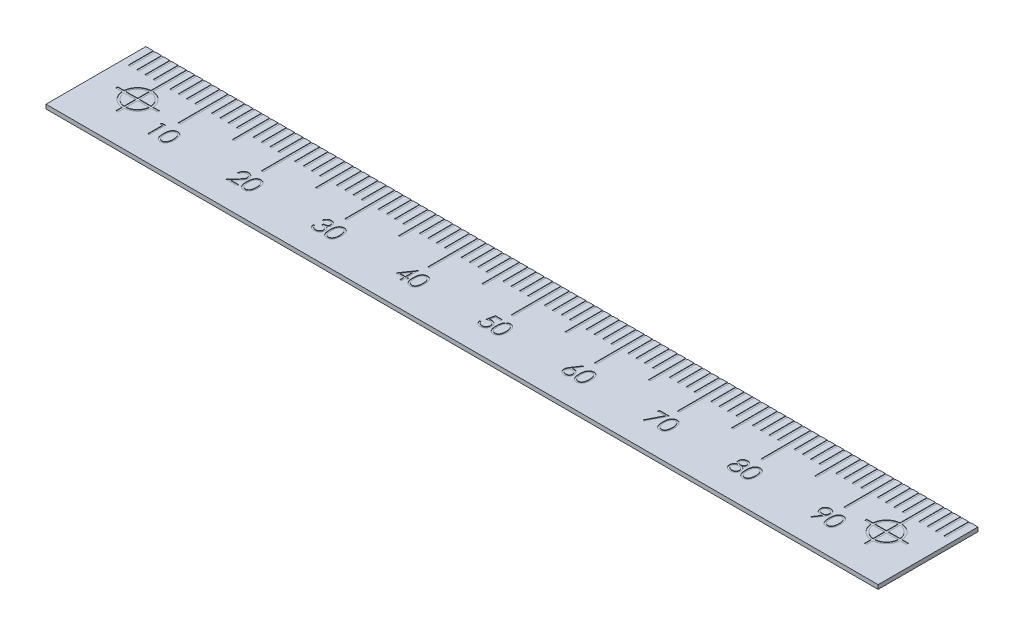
from build123d import *

# Parameters (mm, degrees)
SKETCH1_W           = 100
SKETCH1_H           = 12
BOSS_EXTRUDE1_DEPTH = 0.5
SKETCH2_W           = 0.25
SKETCH2_H           = 3
CUT_EXTRUDE2_DEPTH  = 0.05
LPATTERN2_COUNT     = 99
LPATTERN2_PITCH     = 1
SKETCH3_W           = 0.25
SKETCH3_H           = 3
CUT_EXTRUDE3_DEPTH  = 0.05
LPATTERN3_COUNT     = 9
LPATTERN3_PITCH     = 10
SKETCH4_W           = 0.25
SKETCH4_H           = 1.5
CUT_EXTRUDE4_DEPTH  = 0.05
LPATTERN4_COUNT     = 9
LPATTERN4_PITCH     = 10
LPATTERN4_COL_COUNT = 2
LPATTERN4_COL_PITCH = 10
CUT_EXTRUDE6_DEPTH  = 0.05
LPATTERN5_COUNT     = 2
LPATTERN5_PITCH     = 90
CUT_EXTRUDE7_DEPTH  = 0.05
CUT_EXTRUDE8_DEPTH  = 0.05


with BuildPart() as part:
    # Sketch1 → Boss-Extrude1 (new body)
    with BuildSketch(Plane(origin=(0, 0, 0), x_dir=(1, 0, 0), z_dir=(0, 1, 0))):
        Rectangle(SKETCH1_W, SKETCH1_H)
    extrude(amount=-BOSS_EXTRUDE1_DEPTH)

    # Sketch2 → Cut-Extrude2 (cut)
    with BuildSketch(Plane(origin=(0, 0, 0), x_dir=(1, 0, 0), z_dir=(0, 1, 0))):
        with Locations((-49, 4.5)):
            Rectangle(SKETCH2_W, SKETCH2_H)
    cut_extrude2 = extrude(amount=-CUT_EXTRUDE2_DEPTH, mode=Mode.SUBTRACT)

    # LPattern2: Cut-Extrude2 ×99
    with Locations(*[(i * LPATTERN2_PITCH, 0, 0) for i in range(1, LPATTERN2_COUNT)]):
        add(cut_extrude2, mode=Mode.SUBTRACT)

    # Sketch3 → Cut-Extrude3 (cut)
    with BuildSketch(Plane(origin=(0, 0, 0), x_dir=(1, 0, 0), z_dir=(0, 1, 0))):
        with Locations((-40, 1.5)):
            Rectangle(SKETCH3_W, SKETCH3_H)
    cut_extrude3 = extrude(amount=-CUT_EXTRUDE3_DEPTH, mode=Mode.SUBTRACT)

    # LPattern3: Cut-Extrude3 ×9
    with Locations(*[(i * LPATTERN3_PITCH, 0, 0) for i in range(1, LPATTERN3_COUNT)]):
        add(cut_extrude3, mode=Mode.SUBTRACT)

    # Sketch4 → Cut-Extrude4 (cut)
    with BuildSketch(Plane(origin=(0, 0, 0), x_dir=(1, 0, 0), z_dir=(0, 1, 0))):
        with Locations((-35, 2.25)):
            Rectangle(SKETCH4_W, SKETCH4_H)
    cut_extrude4 = extrude(amount=-CUT_EXTRUDE4_DEPTH, mode=Mode.SUBTRACT)

    # LPattern4: Cut-Extrude4 ×9
    with Locations(*[(i * LPATTERN4_PITCH, 0, 0) for i in range(1, LPATTERN4_COUNT)]):
        add(cut_extrude4, mode=Mode.SUBTRACT)

    # LPattern4 col: Cut-Extrude4 ×2
    with Locations(*[(-i * LPATTERN4_COL_PITCH, 0, 0) for i in range(1, LPATTERN4_COL_COUNT)]):
        add(cut_extrude4, mode=Mode.SUBTRACT)

    # Sketch5 → Cut-Extrude6 (cut)
    with BuildSketch(Plane(origin=(0, 0, 0), x_dir=(1, 0, 0), z_dir=(0, 1, 0))):
        with BuildLine():
            Line((-45.12, 2.5), (-44.87, 2.5))
            Line((-44.87, 2.5), (-44.87, 1.745530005))
            ThreePointArc((-44.87, 1.745530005), (-43.757563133, 1.237436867), (-43.249469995, 0.125))
            Line((-43.249469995, 0.125), (-42.495, 0.125))
            Line((-42.495, 0.125), (-42.495, -0.125))
            Line((-42.495, -0.125), (-43.249469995, -0.125))
            ThreePointArc((-43.249469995, -0.125), (-43.757563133, -1.237436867), (-44.87, -1.745530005))
            Line((-44.87, -1.745530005), (-44.87, -2.5))
            Line((-44.87, -2.5), (-45.12, -2.5))
            Line((-45.12, -2.5), (-45.12, -1.745530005))
            ThreePointArc((-45.12, -1.745530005), (-46.232436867, -1.237436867), (-46.740530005, -0.125))
            Line((-46.740530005, -0.125), (-47.495, -0.125))
            Line((-47.495, -0.125), (-47.495, 0.125))
            Line((-47.495, 0.125), (-46.740530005, 0.125))
            ThreePointArc((-46.740530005, 0.125), (-46.232436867, 1.237436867), (-45.12, 1.745530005))
            Line((-45.12, 1.745530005), (-45.12, 2.5))
        make_face()
        with BuildLine():
            Line((-45.12, 1.494782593), (-45.12, 0.125))
            Line((-45.12, 0.125), (-46.489782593, 0.125))
            ThreePointArc((-46.489782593, 0.125), (-46.055660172, 1.060660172), (-45.12, 1.494782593))
        make_face(mode=Mode.SUBTRACT)
        with BuildLine():
            Line((-44.87, 1.494782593), (-44.87, 0.125))
            Line((-44.87, 0.125), (-43.500217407, 0.125))
            ThreePointArc((-43.500217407, 0.125), (-43.934339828, 1.060660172), (-44.87, 1.494782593))
        make_face(mode=Mode.SUBTRACT)
        with BuildLine():
            Line((-46.489782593, -0.125), (-45.12, -0.125))
            Line((-45.12, -0.125), (-45.12, -1.494782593))
            ThreePointArc((-45.12, -1.494782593), (-46.055660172, -1.060660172), (-46.489782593, -0.125))
        make_face(mode=Mode.SUBTRACT)
        with BuildLine():
            Line((-44.87, -0.125), (-44.87, -1.494782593))
            ThreePointArc((-44.87, -1.494782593), (-43.934339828, -1.060660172), (-43.500217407, -0.125))
            Line((-43.500217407, -0.125), (-44.87, -0.125))
        make_face(mode=Mode.SUBTRACT)
    cut_extrude6 = extrude(amount=-CUT_EXTRUDE6_DEPTH, mode=Mode.SUBTRACT)

    # LPattern5: Cut-Extrude6 ×2
    with Locations(*[(i * LPATTERN5_PITCH, 0, 0) for i in range(1, LPATTERN5_COUNT)]):
        add(cut_extrude6, mode=Mode.SUBTRACT)

    # Sketch7 → Cut-Extrude7 (cut)
    # profile 1 of 8: a face of its own
    with BuildSketch(Plane(origin=(0, 0, 0), x_dir=(1, 0, 0), z_dir=(0, 1, 0))):
        Polygon((-40.997996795, -1), (-40.628205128, -1), (-40.628205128, -3), (-40.807692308, -3), (-40.807692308, -1.205128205), (-41.115384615, -1.205128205), align=None)
    # profile 2 of 8: a face of its own
    with BuildSketch(Plane(origin=(0, 0, 0), x_dir=(1, 0, 0), z_dir=(0, 1, 0))):
        with BuildLine():
            add(Edge.make_bspline(
                [(-39.884615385, -2.000801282), (-39.884427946, -1.968745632), (-39.884063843, -1.906477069), (-39.880013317, -1.815742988), (-39.87328455, -1.730622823), (-39.864063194, -1.6511125), (-39.852841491, -1.577191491), (-39.837861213, -1.509057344), (-39.820825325, -1.446394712), (-39.801081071, -1.388999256), (-39.778802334, -1.336097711), (-39.754554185, -1.286711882), (-39.727374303, -1.240916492), (-39.698816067, -1.197980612), (-39.667723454, -1.158607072), (-39.634981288, -1.122239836), (-39.599311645, -1.089719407), (-39.561927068, -1.060092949), (-39.522489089, -1.034121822), (-39.482121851, -1.011245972), (-39.440547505, -0.99170319), (-39.397652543, -0.976337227), (-39.35382251, -0.963645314), (-39.308904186, -0.954965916), (-39.262823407, -0.949504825), (-39.23171973, -0.948982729), (-39.215945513, -0.948717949)],
                knots=[0, 0, 0, 0, 1.646270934, 3.197905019, 4.663502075, 6.030701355, 7.308322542, 8.50163776, 9.611534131, 10.641858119, 11.616356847, 12.558055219, 13.465016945, 14.349605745, 15.204443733, 16.039544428, 16.859896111, 17.680448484, 18.487036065, 19.28249412, 20.06191084, 20.843045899, 21.620316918, 22.403196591, 23.190181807, 24, 24, 24, 24], degree=3))
            add(Edge.make_bspline(
                [(-39.215945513, -0.948717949), (-39.200039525, -0.9489967), (-39.16840752, -0.949551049), (-39.121641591, -0.954879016), (-39.075956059, -0.963719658), (-39.031545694, -0.976245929), (-38.988045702, -0.991786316), (-38.945796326, -1.011264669), (-38.904535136, -1.033938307), (-38.864917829, -1.060580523), (-38.826509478, -1.090284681), (-38.790253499, -1.123863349), (-38.756146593, -1.160977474), (-38.723760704, -1.201229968), (-38.694014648, -1.245392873), (-38.665686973, -1.292698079), (-38.640331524, -1.343972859), (-38.615911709, -1.398361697), (-38.594833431, -1.457369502), (-38.575824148, -1.520663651), (-38.560464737, -1.588991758), (-38.547670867, -1.661995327), (-38.537759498, -1.73994246), (-38.530540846, -1.822666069), (-38.526727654, -1.910220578), (-38.526009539, -1.970082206), (-38.525641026, -2.000801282)],
                knots=[0, 0, 0, 0, 0.810914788, 1.612654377, 2.396697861, 3.181598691, 3.963628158, 4.749916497, 5.551656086, 6.361998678, 7.18212741, 8.025565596, 8.878627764, 9.750805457, 10.657531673, 11.591944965, 12.560506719, 13.57287815, 14.630710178, 15.753379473, 16.941251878, 18.199788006, 19.531962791, 20.947069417, 22.433333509, 24, 24, 24, 24], degree=3))
            add(Edge.make_bspline(
                [(-38.525641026, -2.000801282), (-38.52601336, -2.031386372), (-38.526738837, -2.090980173), (-38.530498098, -2.178140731), (-38.53790303, -2.260425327), (-38.547165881, -2.338031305), (-38.559995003, -2.410635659), (-38.575769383, -2.47848963), (-38.593283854, -2.541886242), (-38.614903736, -2.600306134), (-38.638566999, -2.654564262), (-38.664312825, -2.705231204), (-38.691895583, -2.752754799), (-38.721946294, -2.796754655), (-38.753976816, -2.837542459), (-38.788672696, -2.874398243), (-38.825055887, -2.908210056), (-38.863577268, -2.9382967), (-38.90381244, -2.964630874), (-38.944931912, -2.988181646), (-38.987665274, -3.007171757), (-39.031044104, -3.023477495), (-39.075688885, -3.035934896), (-39.121543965, -3.044548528), (-39.1683761, -3.050589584), (-39.200034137, -3.05105043), (-39.215945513, -3.051282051)],
                knots=[0, 0, 0, 0, 1.561518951, 3.042555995, 4.452378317, 5.7783523, 7.031515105, 8.214008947, 9.334062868, 10.386615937, 11.391082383, 12.354592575, 13.286541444, 14.194233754, 15.072674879, 15.931287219, 16.775624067, 17.606195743, 18.42308326, 19.229000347, 20.022332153, 20.807536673, 21.593273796, 22.3848459, 23.188221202, 24, 24, 24, 24], degree=3))
            add(Edge.make_bspline(
                [(-39.215945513, -3.051282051), (-39.231719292, -3.051015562), (-39.262822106, -3.050490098), (-39.308909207, -3.04505368), (-39.353642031, -3.036313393), (-39.397241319, -3.024075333), (-39.439930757, -3.009095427), (-39.481128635, -2.989579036), (-39.521293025, -2.967102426), (-39.560316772, -2.941505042), (-39.597466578, -2.912178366), (-39.632951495, -2.879741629), (-39.665880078, -2.843385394), (-39.696528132, -2.803683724), (-39.725656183, -2.761001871), (-39.75245011, -2.714757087), (-39.777233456, -2.665132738), (-39.799886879, -2.611808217), (-39.819971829, -2.554005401), (-39.837713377, -2.491063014), (-39.851721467, -2.422425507), (-39.863711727, -2.348644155), (-39.873382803, -2.269401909), (-39.879985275, -2.18465575), (-39.884066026, -2.094458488), (-39.884428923, -2.032590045), (-39.884615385, -2.000801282)],
                knots=[0, 0, 0, 0, 0.810891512, 1.598919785, 2.382837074, 3.152667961, 3.926044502, 4.706494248, 5.493654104, 6.291793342, 7.103789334, 7.925228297, 8.761435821, 9.622817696, 10.50288917, 11.416980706, 12.369136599, 13.353924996, 14.394355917, 15.514179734, 16.714354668, 17.994756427, 19.357759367, 20.818452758, 22.365282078, 24, 24, 24, 24], degree=3))
        make_face()
        with BuildLine():
            add(Edge.make_bspline(
                [(-39.705128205, -2), (-39.70505995, -2.026713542), (-39.704927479, -2.078559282), (-39.701466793, -2.153898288), (-39.696752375, -2.224167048), (-39.690671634, -2.289454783), (-39.681641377, -2.349540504), (-39.671523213, -2.404837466), (-39.659210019, -2.45505303), (-39.644641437, -2.500531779), (-39.628047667, -2.542045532), (-39.609930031, -2.580674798), (-39.590466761, -2.616875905), (-39.568684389, -2.650323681), (-39.544961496, -2.681127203), (-39.519833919, -2.709831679), (-39.492363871, -2.735429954), (-39.454361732, -2.766131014), (-39.404192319, -2.797856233), (-39.34098063, -2.82548257), (-39.276027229, -2.842843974), (-39.231940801, -2.845051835), (-39.209935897, -2.846153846)],
                knots=[0, 0, 0, 0, 1.459021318, 2.831673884, 4.118529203, 5.306027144, 6.411944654, 7.436330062, 8.375795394, 9.233974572, 10.042671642, 10.816086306, 11.563610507, 12.285937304, 12.993564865, 13.685989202, 14.367179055, 15.041617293, 16.353048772, 17.594441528, 18.799311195, 20, 20, 20, 20], degree=3))
            add(Edge.make_bspline(
                [(-39.209935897, -2.846153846), (-39.187788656, -2.845240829), (-39.1435399, -2.843416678), (-39.078892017, -2.8258174), (-39.016131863, -2.799263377), (-38.966947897, -2.767864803), (-38.929529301, -2.7379629), (-38.902719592, -2.712468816), (-38.878112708, -2.683922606), (-38.854774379, -2.653123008), (-38.833369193, -2.619481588), (-38.813904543, -2.583160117), (-38.79614263, -2.544057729), (-38.786023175, -2.516760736), (-38.780849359, -2.502804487)],
                knots=[0, 0, 0, 0, 1.353760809, 2.704726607, 4.075137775, 5.516104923, 6.260822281, 7.007110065, 7.778089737, 8.566572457, 9.372053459, 10.217411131, 11.088608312, 12, 12, 12, 12], degree=3))
            add(Edge.make_bspline(
                [(-38.780849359, -2.502804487), (-38.774819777, -2.484958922), (-38.762577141, -2.448724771), (-38.746798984, -2.39251697), (-38.734373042, -2.333543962), (-38.723193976, -2.272158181), (-38.715563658, -2.207906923), (-38.70942205, -2.140988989), (-38.705804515, -2.071353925), (-38.705356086, -2.024042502), (-38.705128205, -2)],
                knots=[0, 0, 0, 0, 0.884706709, 1.796334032, 2.740027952, 3.714592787, 4.726048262, 5.777819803, 6.87074269, 8, 8, 8, 8], degree=3))
            add(Edge.make_bspline(
                [(-38.705128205, -2), (-38.705442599, -1.975961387), (-38.706057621, -1.928936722), (-38.708408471, -1.86006919), (-38.714479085, -1.794659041), (-38.721221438, -1.732424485), (-38.731162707, -1.673710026), (-38.741881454, -1.618024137), (-38.756282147, -1.566056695), (-38.771664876, -1.516994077), (-38.789270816, -1.471393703), (-38.808651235, -1.429042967), (-38.829349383, -1.38973741), (-38.851830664, -1.353584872), (-38.875828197, -1.320423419), (-38.901975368, -1.290917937), (-38.929235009, -1.264153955), (-38.967416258, -1.233603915), (-39.017401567, -1.202454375), (-39.07959908, -1.173788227), (-39.144325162, -1.157326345), (-39.188081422, -1.155005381), (-39.209935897, -1.153846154)],
                knots=[0, 0, 0, 0, 1.31362396, 2.569729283, 3.763502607, 4.902122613, 5.988968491, 7.01645872, 7.998833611, 8.933434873, 9.825090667, 10.667526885, 11.477055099, 12.250526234, 12.991942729, 13.710640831, 14.402115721, 15.076753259, 16.378508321, 17.609869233, 18.806226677, 20, 20, 20, 20], degree=3))
            add(Edge.make_bspline(
                [(-39.209935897, -1.153846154), (-39.232056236, -1.155006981), (-39.27633721, -1.157330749), (-39.341736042, -1.173726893), (-39.404424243, -1.202305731), (-39.454277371, -1.233707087), (-39.492485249, -1.263614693), (-39.519389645, -1.28954981), (-39.544616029, -1.317919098), (-39.567854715, -1.349005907), (-39.58962002, -1.382414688), (-39.60960917, -1.418408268), (-39.627619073, -1.457169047), (-39.644238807, -1.498664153), (-39.658851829, -1.544138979), (-39.670905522, -1.594292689), (-39.682040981, -1.64941377), (-39.689923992, -1.709824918), (-39.696931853, -1.775129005), (-39.70143548, -1.845573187), (-39.704939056, -1.921038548), (-39.705063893, -1.973152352), (-39.705128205, -2)],
                knots=[0, 0, 0, 0, 1.207732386, 2.417664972, 3.655092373, 4.956220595, 5.625982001, 6.301752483, 6.994047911, 7.697131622, 8.419323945, 9.170223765, 9.943494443, 10.752040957, 11.610060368, 12.549350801, 13.567764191, 14.679664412, 15.874934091, 17.154273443, 18.533957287, 20, 20, 20, 20], degree=3))
        make_face(mode=Mode.SUBTRACT)
    # profile 3 of 8: a face of its own
    with BuildSketch(Plane(origin=(0, 0, 0), x_dir=(1, 0, 0), z_dir=(0, 1, 0))):
        with BuildLine():
            Line((-31.166666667, -1.615384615), (-31.346153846, -1.615384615))
            add(Edge.make_bspline(
                [(-31.346153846, -1.615384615), (-31.344984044, -1.59157268), (-31.342686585, -1.544806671), (-31.331927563, -1.476621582), (-31.316532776, -1.411447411), (-31.29476623, -1.34980746), (-31.267734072, -1.291156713), (-31.235316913, -1.235728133), (-31.196920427, -1.183733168), (-31.153373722, -1.135653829), (-31.106077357, -1.091546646), (-31.055045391, -1.053457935), (-31.001419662, -1.021276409), (-30.945362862, -0.994372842), (-30.88624254, -0.974178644), (-30.824595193, -0.95919485), (-30.760149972, -0.950179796), (-30.716241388, -0.949210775), (-30.693910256, -0.948717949)],
                knots=[0, 0, 0, 0, 1.10065271, 2.161652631, 3.183658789, 4.190468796, 5.17591951, 6.163126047, 7.15150782, 8.156236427, 9.156009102, 10.134482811, 11.092018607, 12.041330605, 13.001268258, 13.972401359, 14.968799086, 16, 16, 16, 16], degree=3))
            add(Edge.make_bspline(
                [(-30.693910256, -0.948717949), (-30.671979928, -0.949231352), (-30.628887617, -0.950240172), (-30.565995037, -0.958903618), (-30.506122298, -0.972472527), (-30.449386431, -0.991509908), (-30.396240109, -1.017101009), (-30.346284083, -1.04784246), (-30.29892362, -1.083396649), (-30.256291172, -1.125255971), (-30.217143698, -1.169943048), (-30.183370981, -1.217650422), (-30.154449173, -1.266924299), (-30.130341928, -1.318140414), (-30.112595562, -1.371781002), (-30.099122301, -1.427065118), (-30.091506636, -1.48456501), (-30.090337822, -1.523483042), (-30.08974359, -1.543269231)],
                knots=[0, 0, 0, 0, 1.111607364, 2.184268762, 3.212621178, 4.221274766, 5.211760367, 6.196651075, 7.1921475, 8.207485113, 9.220403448, 10.201281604, 11.166441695, 12.114753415, 13.065576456, 14.026450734, 14.996634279, 16, 16, 16, 16], degree=3))
            add(Edge.make_bspline(
                [(-30.08974359, -1.543269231), (-30.090711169, -1.571125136), (-30.092629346, -1.626348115), (-30.109037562, -1.707499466), (-30.134664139, -1.786124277), (-30.165519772, -1.849402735), (-30.196646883, -1.900393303), (-30.224696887, -1.94237542), (-30.257533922, -1.987578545), (-30.295635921, -2.035851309), (-30.338214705, -2.087571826), (-30.385655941, -2.142708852), (-30.438297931, -2.20069272), (-30.475245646, -2.240295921), (-30.494391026, -2.260817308)],
                knots=[0, 0, 0, 0, 1.184426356, 2.348067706, 3.509069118, 4.696110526, 5.333549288, 6.050745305, 6.844228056, 7.710549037, 8.667450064, 9.695053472, 10.805634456, 12, 12, 12, 12], degree=3))
            Line((-30.494391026, -2.260817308), (-30.994791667, -2.794871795))
            Line((-30.994791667, -2.794871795), (-30.064102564, -2.794871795))
            Line((-30.064102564, -2.794871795), (-30.064102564, -3))
            Line((-30.064102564, -3), (-31.423076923, -3))
            Line((-31.423076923, -3), (-30.647435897, -2.172275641))
            add(Edge.make_bspline(
                [(-30.647435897, -2.172275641), (-30.628551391, -2.152562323), (-30.592278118, -2.114697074), (-30.540973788, -2.059415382), (-30.494894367, -2.00812993), (-30.453741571, -1.960937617), (-30.418408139, -1.917148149), (-30.387052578, -1.878179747), (-30.361929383, -1.842320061), (-30.334663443, -1.800753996), (-30.308255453, -1.750004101), (-30.285562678, -1.68798485), (-30.271725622, -1.624140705), (-30.270065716, -1.580996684), (-30.269230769, -1.559294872)],
                knots=[0, 0, 0, 0, 1.329631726, 2.553950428, 3.673215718, 4.687767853, 5.603093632, 6.413772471, 7.123043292, 7.734684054, 8.834405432, 9.900288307, 10.943827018, 12, 12, 12, 12], degree=3))
            add(Edge.make_bspline(
                [(-30.269230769, -1.559294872), (-30.269594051, -1.545648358), (-30.270310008, -1.518753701), (-30.276628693, -1.479321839), (-30.286177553, -1.441284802), (-30.299860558, -1.404525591), (-30.317921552, -1.36941379), (-30.339906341, -1.335906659), (-30.365272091, -1.303512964), (-30.394615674, -1.273139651), (-30.426850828, -1.245321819), (-30.460904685, -1.220679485), (-30.496933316, -1.200085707), (-30.534784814, -1.183203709), (-30.574353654, -1.169960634), (-30.615716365, -1.160784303), (-30.65875866, -1.155022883), (-30.688149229, -1.154243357), (-30.703125, -1.153846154)],
                knots=[0, 0, 0, 0, 0.991446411, 1.95395049, 2.89581595, 3.838931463, 4.798493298, 5.75982156, 6.748411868, 7.785213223, 8.824556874, 9.840280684, 10.836137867, 11.835679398, 12.848801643, 13.863922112, 14.911575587, 16, 16, 16, 16], degree=3))
            add(Edge.make_bspline(
                [(-30.703125, -1.153846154), (-30.718765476, -1.154254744), (-30.749480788, -1.155057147), (-30.794577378, -1.160670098), (-30.837597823, -1.170353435), (-30.878650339, -1.183597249), (-30.917804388, -1.200430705), (-30.954869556, -1.221397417), (-30.989762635, -1.246416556), (-31.02254922, -1.274782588), (-31.052757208, -1.306364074), (-31.07929828, -1.341569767), (-31.102489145, -1.379756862), (-31.122722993, -1.420822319), (-31.139154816, -1.465138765), (-31.151710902, -1.512548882), (-31.161646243, -1.562846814), (-31.164965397, -1.597581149), (-31.166666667, -1.615384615)],
                knots=[0, 0, 0, 0, 1.031018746, 2.02475058, 2.990194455, 3.934040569, 4.864654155, 5.795059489, 6.735614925, 7.690564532, 8.649604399, 9.611025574, 10.590972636, 11.591080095, 12.624614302, 13.701020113, 14.821632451, 16, 16, 16, 16], degree=3))
        make_face()
    # profile 4 of 8: a face of its own
    with BuildSketch(Plane(origin=(0, 0, 0), x_dir=(1, 0, 0), z_dir=(0, 1, 0))):
        with BuildLine():
            add(Edge.make_bspline(
                [(-29.884615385, -2.000801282), (-29.884427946, -1.968745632), (-29.884063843, -1.906477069), (-29.880013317, -1.815742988), (-29.87328455, -1.730622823), (-29.864063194, -1.6511125), (-29.852841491, -1.577191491), (-29.837861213, -1.509057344), (-29.820825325, -1.446394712), (-29.801081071, -1.388999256), (-29.778802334, -1.336097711), (-29.754554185, -1.286711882), (-29.727374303, -1.240916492), (-29.698816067, -1.197980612), (-29.667723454, -1.158607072), (-29.634981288, -1.122239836), (-29.599311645, -1.089719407), (-29.561927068, -1.060092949), (-29.522489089, -1.034121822), (-29.482121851, -1.011245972), (-29.440547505, -0.99170319), (-29.397652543, -0.976337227), (-29.35382251, -0.963645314), (-29.308904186, -0.954965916), (-29.262823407, -0.949504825), (-29.23171973, -0.948982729), (-29.215945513, -0.948717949)],
                knots=[0, 0, 0, 0, 1.646270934, 3.197905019, 4.663502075, 6.030701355, 7.308322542, 8.50163776, 9.611534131, 10.641858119, 11.616356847, 12.558055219, 13.465016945, 14.349605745, 15.204443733, 16.039544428, 16.859896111, 17.680448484, 18.487036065, 19.28249412, 20.06191084, 20.843045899, 21.620316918, 22.403196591, 23.190181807, 24, 24, 24, 24], degree=3))
            add(Edge.make_bspline(
                [(-29.215945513, -0.948717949), (-29.200039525, -0.9489967), (-29.16840752, -0.949551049), (-29.121641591, -0.954879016), (-29.075956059, -0.963719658), (-29.031545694, -0.976245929), (-28.988045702, -0.991786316), (-28.945796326, -1.011264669), (-28.904535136, -1.033938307), (-28.864917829, -1.060580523), (-28.826509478, -1.090284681), (-28.790253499, -1.123863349), (-28.756146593, -1.160977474), (-28.723760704, -1.201229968), (-28.694014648, -1.245392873), (-28.665686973, -1.292698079), (-28.640331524, -1.343972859), (-28.615911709, -1.398361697), (-28.594833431, -1.457369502), (-28.575824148, -1.520663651), (-28.560464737, -1.588991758), (-28.547670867, -1.661995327), (-28.537759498, -1.73994246), (-28.530540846, -1.822666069), (-28.526727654, -1.910220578), (-28.526009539, -1.970082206), (-28.525641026, -2.000801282)],
                knots=[0, 0, 0, 0, 0.810914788, 1.612654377, 2.396697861, 3.181598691, 3.963628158, 4.749916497, 5.551656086, 6.361998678, 7.18212741, 8.025565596, 8.878627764, 9.750805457, 10.657531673, 11.591944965, 12.560506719, 13.57287815, 14.630710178, 15.753379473, 16.941251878, 18.199788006, 19.531962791, 20.947069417, 22.433333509, 24, 24, 24, 24], degree=3))
            add(Edge.make_bspline(
                [(-28.525641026, -2.000801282), (-28.52601336, -2.031386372), (-28.526738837, -2.090980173), (-28.530498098, -2.178140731), (-28.53790303, -2.260425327), (-28.547165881, -2.338031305), (-28.559995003, -2.410635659), (-28.575769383, -2.47848963), (-28.593283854, -2.541886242), (-28.614903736, -2.600306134), (-28.638566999, -2.654564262), (-28.664312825, -2.705231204), (-28.691895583, -2.752754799), (-28.721946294, -2.796754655), (-28.753976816, -2.837542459), (-28.788672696, -2.874398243), (-28.825055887, -2.908210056), (-28.863577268, -2.9382967), (-28.90381244, -2.964630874), (-28.944931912, -2.988181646), (-28.987665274, -3.007171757), (-29.031044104, -3.023477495), (-29.075688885, -3.035934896), (-29.121543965, -3.044548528), (-29.1683761, -3.050589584), (-29.200034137, -3.05105043), (-29.215945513, -3.051282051)],
                knots=[0, 0, 0, 0, 1.561518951, 3.042555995, 4.452378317, 5.7783523, 7.031515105, 8.214008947, 9.334062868, 10.386615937, 11.391082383, 12.354592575, 13.286541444, 14.194233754, 15.072674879, 15.931287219, 16.775624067, 17.606195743, 18.42308326, 19.229000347, 20.022332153, 20.807536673, 21.593273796, 22.3848459, 23.188221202, 24, 24, 24, 24], degree=3))
            add(Edge.make_bspline(
                [(-29.215945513, -3.051282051), (-29.231719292, -3.051015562), (-29.262822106, -3.050490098), (-29.308909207, -3.04505368), (-29.353642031, -3.036313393), (-29.397241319, -3.024075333), (-29.439930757, -3.009095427), (-29.481128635, -2.989579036), (-29.521293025, -2.967102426), (-29.560316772, -2.941505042), (-29.597466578, -2.912178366), (-29.632951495, -2.879741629), (-29.665880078, -2.843385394), (-29.696528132, -2.803683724), (-29.725656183, -2.761001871), (-29.75245011, -2.714757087), (-29.777233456, -2.665132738), (-29.799886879, -2.611808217), (-29.819971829, -2.554005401), (-29.837713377, -2.491063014), (-29.851721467, -2.422425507), (-29.863711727, -2.348644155), (-29.873382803, -2.269401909), (-29.879985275, -2.18465575), (-29.884066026, -2.094458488), (-29.884428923, -2.032590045), (-29.884615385, -2.000801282)],
                knots=[0, 0, 0, 0, 0.810891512, 1.598919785, 2.382837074, 3.152667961, 3.926044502, 4.706494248, 5.493654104, 6.291793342, 7.103789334, 7.925228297, 8.761435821, 9.622817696, 10.50288917, 11.416980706, 12.369136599, 13.353924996, 14.394355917, 15.514179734, 16.714354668, 17.994756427, 19.357759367, 20.818452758, 22.365282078, 24, 24, 24, 24], degree=3))
        make_face()
        with BuildLine():
            add(Edge.make_bspline(
                [(-29.705128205, -2), (-29.70505995, -2.026713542), (-29.704927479, -2.078559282), (-29.701466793, -2.153898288), (-29.696752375, -2.224167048), (-29.690671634, -2.289454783), (-29.681641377, -2.349540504), (-29.671523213, -2.404837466), (-29.659210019, -2.45505303), (-29.644641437, -2.500531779), (-29.628047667, -2.542045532), (-29.609930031, -2.580674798), (-29.590466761, -2.616875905), (-29.568684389, -2.650323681), (-29.544961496, -2.681127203), (-29.519833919, -2.709831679), (-29.492363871, -2.735429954), (-29.454361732, -2.766131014), (-29.404192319, -2.797856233), (-29.34098063, -2.82548257), (-29.276027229, -2.842843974), (-29.231940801, -2.845051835), (-29.209935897, -2.846153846)],
                knots=[0, 0, 0, 0, 1.459021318, 2.831673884, 4.118529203, 5.306027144, 6.411944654, 7.436330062, 8.375795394, 9.233974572, 10.042671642, 10.816086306, 11.563610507, 12.285937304, 12.993564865, 13.685989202, 14.367179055, 15.041617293, 16.353048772, 17.594441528, 18.799311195, 20, 20, 20, 20], degree=3))
            add(Edge.make_bspline(
                [(-29.209935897, -2.846153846), (-29.187788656, -2.845240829), (-29.1435399, -2.843416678), (-29.078892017, -2.8258174), (-29.016131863, -2.799263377), (-28.966947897, -2.767864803), (-28.929529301, -2.7379629), (-28.902719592, -2.712468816), (-28.878112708, -2.683922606), (-28.854774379, -2.653123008), (-28.833369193, -2.619481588), (-28.813904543, -2.583160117), (-28.79614263, -2.544057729), (-28.786023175, -2.516760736), (-28.780849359, -2.502804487)],
                knots=[0, 0, 0, 0, 1.353760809, 2.704726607, 4.075137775, 5.516104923, 6.260822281, 7.007110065, 7.778089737, 8.566572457, 9.372053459, 10.217411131, 11.088608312, 12, 12, 12, 12], degree=3))
            add(Edge.make_bspline(
                [(-28.780849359, -2.502804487), (-28.774819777, -2.484958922), (-28.762577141, -2.448724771), (-28.746798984, -2.39251697), (-28.734373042, -2.333543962), (-28.723193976, -2.272158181), (-28.715563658, -2.207906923), (-28.70942205, -2.140988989), (-28.705804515, -2.071353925), (-28.705356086, -2.024042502), (-28.705128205, -2)],
                knots=[0, 0, 0, 0, 0.884706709, 1.796334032, 2.740027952, 3.714592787, 4.726048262, 5.777819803, 6.87074269, 8, 8, 8, 8], degree=3))
            add(Edge.make_bspline(
                [(-28.705128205, -2), (-28.705442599, -1.975961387), (-28.706057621, -1.928936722), (-28.708408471, -1.86006919), (-28.714479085, -1.794659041), (-28.721221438, -1.732424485), (-28.731162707, -1.673710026), (-28.741881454, -1.618024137), (-28.756282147, -1.566056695), (-28.771664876, -1.516994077), (-28.789270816, -1.471393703), (-28.808651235, -1.429042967), (-28.829349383, -1.38973741), (-28.851830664, -1.353584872), (-28.875828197, -1.320423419), (-28.901975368, -1.290917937), (-28.929235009, -1.264153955), (-28.967416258, -1.233603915), (-29.017401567, -1.202454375), (-29.07959908, -1.173788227), (-29.144325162, -1.157326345), (-29.188081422, -1.155005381), (-29.209935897, -1.153846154)],
                knots=[0, 0, 0, 0, 1.31362396, 2.569729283, 3.763502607, 4.902122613, 5.988968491, 7.01645872, 7.998833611, 8.933434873, 9.825090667, 10.667526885, 11.477055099, 12.250526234, 12.991942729, 13.710640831, 14.402115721, 15.076753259, 16.378508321, 17.609869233, 18.806226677, 20, 20, 20, 20], degree=3))
            add(Edge.make_bspline(
                [(-29.209935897, -1.153846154), (-29.232056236, -1.155006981), (-29.27633721, -1.157330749), (-29.341736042, -1.173726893), (-29.404424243, -1.202305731), (-29.454277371, -1.233707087), (-29.492485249, -1.263614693), (-29.519389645, -1.28954981), (-29.544616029, -1.317919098), (-29.567854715, -1.349005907), (-29.58962002, -1.382414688), (-29.60960917, -1.418408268), (-29.627619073, -1.457169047), (-29.644238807, -1.498664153), (-29.658851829, -1.544138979), (-29.670905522, -1.594292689), (-29.682040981, -1.64941377), (-29.689923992, -1.709824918), (-29.696931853, -1.775129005), (-29.70143548, -1.845573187), (-29.704939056, -1.921038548), (-29.705063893, -1.973152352), (-29.705128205, -2)],
                knots=[0, 0, 0, 0, 1.207732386, 2.417664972, 3.655092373, 4.956220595, 5.625982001, 6.301752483, 6.994047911, 7.697131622, 8.419323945, 9.170223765, 9.943494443, 10.752040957, 11.610060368, 12.549350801, 13.567764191, 14.679664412, 15.874934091, 17.154273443, 18.533957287, 20, 20, 20, 20], degree=3))
        make_face(mode=Mode.SUBTRACT)
    # profile 5 of 8: a face of its own
    with BuildSketch(Plane(origin=(0, 0, 0), x_dir=(1, 0, 0), z_dir=(0, 1, 0))):
        with BuildLine():
            Line((-21.166666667, -1.461538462), (-21.346153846, -1.461538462))
            add(Edge.make_bspline(
                [(-21.346153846, -1.461538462), (-21.341291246, -1.441405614), (-21.33178526, -1.402047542), (-21.311958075, -1.345814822), (-21.2903585, -1.292601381), (-21.264421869, -1.243403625), (-21.236131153, -1.197232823), (-21.203718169, -1.155136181), (-21.168678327, -1.116043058), (-21.129921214, -1.081349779), (-21.089276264, -1.049933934), (-21.046170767, -1.023148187), (-21.001471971, -1.000105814), (-20.95487018, -0.981122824), (-20.906226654, -0.966822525), (-20.855981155, -0.956447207), (-20.804002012, -0.949709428), (-20.768717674, -0.949051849), (-20.750801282, -0.948717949)],
                knots=[0, 0, 0, 0, 1.162005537, 2.271625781, 3.343758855, 4.383309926, 5.390229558, 6.379919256, 7.361854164, 8.333198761, 9.295911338, 10.242430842, 11.177959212, 12.116337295, 13.062827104, 14.020064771, 14.994644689, 16, 16, 16, 16], degree=3))
            add(Edge.make_bspline(
                [(-20.750801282, -0.948717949), (-20.724696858, -0.94950608), (-20.673057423, -0.951065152), (-20.597192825, -0.965301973), (-20.524034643, -0.98783062), (-20.454383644, -1.018958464), (-20.389687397, -1.057351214), (-20.332123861, -1.10304535), (-20.282473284, -1.155159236), (-20.240819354, -1.212720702), (-20.208205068, -1.274238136), (-20.184155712, -1.337552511), (-20.169514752, -1.402513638), (-20.167617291, -1.44637494), (-20.166666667, -1.468349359)],
                knots=[0, 0, 0, 0, 1.083050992, 2.142477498, 3.193116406, 4.255571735, 5.30263384, 6.308962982, 7.297363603, 8.282367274, 9.249857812, 10.179914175, 11.08814088, 12, 12, 12, 12], degree=3))
            add(Edge.make_bspline(
                [(-20.166666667, -1.468349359), (-20.167331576, -1.489496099), (-20.1686327, -1.530876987), (-20.179680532, -1.591289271), (-20.198272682, -1.648227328), (-20.224026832, -1.70193085), (-20.257364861, -1.75205933), (-20.297749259, -1.798725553), (-20.345465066, -1.8421365), (-20.381624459, -1.867004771), (-20.400240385, -1.879807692)],
                knots=[0, 0, 0, 0, 1.024540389, 2.004866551, 2.965041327, 3.920577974, 4.882998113, 5.874504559, 6.905732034, 8, 8, 8, 8], degree=3))
            add(Edge.make_bspline(
                [(-20.400240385, -1.879807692), (-20.378965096, -1.890080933), (-20.336812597, -1.910435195), (-20.279355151, -1.95035277), (-20.227196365, -1.996442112), (-20.198108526, -2.032409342), (-20.18349359, -2.050480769)],
                knots=[0, 0, 0, 0, 1.015518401, 2.012035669, 3.001164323, 4, 4, 4, 4], degree=3))
            add(Edge.make_bspline(
                [(-20.18349359, -2.050480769), (-20.173869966, -2.063656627), (-20.154780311, -2.08979258), (-20.131217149, -2.131813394), (-20.109840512, -2.17429996), (-20.093183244, -2.218391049), (-20.080283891, -2.263575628), (-20.071063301, -2.309931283), (-20.065335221, -2.357495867), (-20.064514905, -2.389674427), (-20.064102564, -2.405849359)],
                knots=[0, 0, 0, 0, 1.025084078, 2.033381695, 3.024893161, 4.013698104, 4.991890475, 5.976764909, 6.982997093, 8, 8, 8, 8], degree=3))
            add(Edge.make_bspline(
                [(-20.064102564, -2.405849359), (-20.065128, -2.433854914), (-20.067174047, -2.489734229), (-20.08546209, -2.572291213), (-20.113812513, -2.6529915), (-20.154073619, -2.730177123), (-20.203140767, -2.802394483), (-20.261516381, -2.867009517), (-20.328537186, -2.922551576), (-20.403283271, -2.968957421), (-20.484264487, -3.006053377), (-20.570879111, -3.031800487), (-20.661879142, -3.048569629), (-20.724283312, -3.05036784), (-20.756009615, -3.051282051)],
                knots=[0, 0, 0, 0, 0.955779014, 1.907060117, 2.875433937, 3.871313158, 4.872415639, 5.851225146, 6.836215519, 7.83643374, 8.849228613, 9.86973379, 10.916971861, 12, 12, 12, 12], degree=3))
            add(Edge.make_bspline(
                [(-20.756009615, -3.051282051), (-20.777392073, -3.050785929), (-20.819465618, -3.049809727), (-20.881319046, -3.043136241), (-20.940360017, -3.030947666), (-20.996668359, -3.014545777), (-21.050294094, -2.993750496), (-21.101073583, -2.967854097), (-21.149319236, -2.937390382), (-21.194575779, -2.90199976), (-21.236837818, -2.862410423), (-21.274982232, -2.81791956), (-21.309644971, -2.769349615), (-21.339897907, -2.71613644), (-21.367119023, -2.658967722), (-21.389508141, -2.597111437), (-21.40921418, -2.531120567), (-21.41837616, -2.485133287), (-21.423076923, -2.461538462)],
                knots=[0, 0, 0, 0, 1.048658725, 2.063410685, 3.046034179, 4.001477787, 4.936774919, 5.862367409, 6.792675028, 7.730719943, 8.675894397, 9.627829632, 10.600096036, 11.597688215, 12.626045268, 13.701542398, 14.82072376, 16, 16, 16, 16], degree=3))
            Line((-21.423076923, -2.461538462), (-21.243589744, -2.461538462))
            add(Edge.make_bspline(
                [(-21.243589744, -2.461538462), (-21.238913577, -2.476937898), (-21.229818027, -2.506891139), (-21.214335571, -2.549999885), (-21.196696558, -2.589518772), (-21.177773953, -2.625737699), (-21.157900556, -2.659013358), (-21.135663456, -2.688465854), (-21.112709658, -2.715388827), (-21.095407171, -2.730557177), (-21.086939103, -2.737980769)],
                knots=[0, 0, 0, 0, 1.198163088, 2.33053128, 3.407730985, 4.417276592, 5.372219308, 6.28897303, 7.162600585, 8, 8, 8, 8], degree=3))
            add(Edge.make_bspline(
                [(-21.086939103, -2.737980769), (-21.075741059, -2.746614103), (-21.053379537, -2.763854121), (-21.016940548, -2.785855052), (-20.978617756, -2.804918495), (-20.937580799, -2.819480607), (-20.894715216, -2.831810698), (-20.84932815, -2.839879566), (-20.801820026, -2.845415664), (-20.769381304, -2.845904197), (-20.752804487, -2.846153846)],
                knots=[0, 0, 0, 0, 0.946170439, 1.889420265, 2.845303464, 3.807233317, 4.801018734, 5.828864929, 6.890507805, 8, 8, 8, 8], degree=3))
            add(Edge.make_bspline(
                [(-20.752804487, -2.846153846), (-20.7340882, -2.8458019), (-20.697490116, -2.845113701), (-20.644087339, -2.838784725), (-20.593283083, -2.829567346), (-20.545641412, -2.815331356), (-20.500538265, -2.797742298), (-20.458605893, -2.775657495), (-20.419293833, -2.749746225), (-20.383105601, -2.720295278), (-20.350565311, -2.688054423), (-20.321914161, -2.654332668), (-20.297557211, -2.619272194), (-20.277909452, -2.582678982), (-20.262394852, -2.544704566), (-20.251833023, -2.505242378), (-20.2444893, -2.464615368), (-20.243891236, -2.436998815), (-20.243589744, -2.423076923)],
                knots=[0, 0, 0, 0, 1.217147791, 2.380027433, 3.494444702, 4.572153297, 5.609568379, 6.639424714, 7.649109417, 8.668170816, 9.669597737, 10.625200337, 11.543417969, 12.441394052, 13.322311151, 14.205496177, 15.095365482, 16, 16, 16, 16], degree=3))
            add(Edge.make_bspline(
                [(-20.243589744, -2.423076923), (-20.244464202, -2.404441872), (-20.246208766, -2.367264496), (-20.259527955, -2.312568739), (-20.281435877, -2.259869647), (-20.312105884, -2.210066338), (-20.349440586, -2.16390868), (-20.393077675, -2.122724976), (-20.44337952, -2.088742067), (-20.489676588, -2.065262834), (-20.530685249, -2.049241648), (-20.565779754, -2.03857024), (-20.605069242, -2.029533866), (-20.648078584, -2.021126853), (-20.695131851, -2.013971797), (-20.746177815, -2.008005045), (-20.801226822, -2.003230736), (-20.83933606, -2.001098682), (-20.858974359, -2)],
                knots=[0, 0, 0, 0, 1.07054697, 2.135767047, 3.216561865, 4.33974944, 5.486079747, 6.621378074, 7.775625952, 8.963672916, 9.598146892, 10.304877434, 11.070270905, 11.915000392, 12.823868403, 13.805723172, 14.86925407, 16, 16, 16, 16], degree=3))
            Line((-20.858974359, -2), (-20.858974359, -1.794871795))
            add(Edge.make_bspline(
                [(-20.858974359, -1.794871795), (-20.834230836, -1.794451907), (-20.785764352, -1.79362945), (-20.714967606, -1.783682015), (-20.647268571, -1.769921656), (-20.584167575, -1.748844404), (-20.526654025, -1.724364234), (-20.476757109, -1.695877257), (-20.435175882, -1.664211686), (-20.402112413, -1.628878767), (-20.377238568, -1.590984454), (-20.359051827, -1.551489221), (-20.348308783, -1.5100469), (-20.346874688, -1.481764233), (-20.346153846, -1.467548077)],
                knots=[0, 0, 0, 0, 1.321986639, 2.589447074, 3.816329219, 5.01088745, 6.139805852, 7.153945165, 8.075214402, 8.924034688, 9.728124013, 10.488707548, 11.240355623, 12, 12, 12, 12], degree=3))
            add(Edge.make_bspline(
                [(-20.346153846, -1.467548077), (-20.346390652, -1.457103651), (-20.346861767, -1.436324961), (-20.352803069, -1.405967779), (-20.361731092, -1.376538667), (-20.374005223, -1.348162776), (-20.390433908, -1.321036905), (-20.410094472, -1.294929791), (-20.433504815, -1.269990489), (-20.460330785, -1.246744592), (-20.48913753, -1.224590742), (-20.52070883, -1.20578295), (-20.554092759, -1.189700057), (-20.589326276, -1.176437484), (-20.626523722, -1.166460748), (-20.665510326, -1.15929741), (-20.706360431, -1.154818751), (-20.734229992, -1.154173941), (-20.748397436, -1.153846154)],
                knots=[0, 0, 0, 0, 0.884392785, 1.759457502, 2.611959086, 3.489218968, 4.37281399, 5.2945488, 6.255912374, 7.266815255, 8.301784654, 9.332968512, 10.37626691, 11.440494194, 12.520033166, 13.637162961, 14.798855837, 16, 16, 16, 16], degree=3))
            add(Edge.make_bspline(
                [(-20.748397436, -1.153846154), (-20.771169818, -1.154641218), (-20.815649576, -1.156194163), (-20.879772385, -1.169795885), (-20.939383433, -1.191497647), (-20.984948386, -1.217402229), (-21.018595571, -1.242973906), (-21.042639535, -1.265306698), (-21.066251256, -1.290125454), (-21.087877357, -1.318958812), (-21.109748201, -1.34985412), (-21.129659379, -1.384381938), (-21.149007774, -1.421641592), (-21.160666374, -1.447981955), (-21.166666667, -1.461538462)],
                knots=[0, 0, 0, 0, 1.472543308, 2.876219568, 4.221790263, 5.565193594, 6.249813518, 6.953379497, 7.687249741, 8.463570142, 9.283606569, 10.136032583, 11.040678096, 12, 12, 12, 12], degree=3))
        make_face()
    # profile 6 of 8: a face of its own
    with BuildSketch(Plane(origin=(0, 0, 0), x_dir=(1, 0, 0), z_dir=(0, 1, 0))):
        with BuildLine():
            add(Edge.make_bspline(
                [(-19.884615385, -2.000801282), (-19.884427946, -1.968745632), (-19.884063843, -1.906477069), (-19.880013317, -1.815742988), (-19.87328455, -1.730622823), (-19.864063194, -1.6511125), (-19.852841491, -1.577191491), (-19.837861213, -1.509057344), (-19.820825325, -1.446394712), (-19.801081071, -1.388999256), (-19.778802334, -1.336097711), (-19.754554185, -1.286711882), (-19.727374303, -1.240916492), (-19.698816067, -1.197980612), (-19.667723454, -1.158607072), (-19.634981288, -1.122239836), (-19.599311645, -1.089719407), (-19.561927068, -1.060092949), (-19.522489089, -1.034121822), (-19.482121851, -1.011245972), (-19.440547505, -0.99170319), (-19.397652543, -0.976337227), (-19.35382251, -0.963645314), (-19.308904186, -0.954965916), (-19.262823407, -0.949504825), (-19.23171973, -0.948982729), (-19.215945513, -0.948717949)],
                knots=[0, 0, 0, 0, 1.646270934, 3.197905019, 4.663502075, 6.030701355, 7.308322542, 8.50163776, 9.611534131, 10.641858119, 11.616356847, 12.558055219, 13.465016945, 14.349605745, 15.204443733, 16.039544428, 16.859896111, 17.680448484, 18.487036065, 19.28249412, 20.06191084, 20.843045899, 21.620316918, 22.403196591, 23.190181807, 24, 24, 24, 24], degree=3))
            add(Edge.make_bspline(
                [(-19.215945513, -0.948717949), (-19.200039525, -0.9489967), (-19.16840752, -0.949551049), (-19.121641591, -0.954879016), (-19.075956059, -0.963719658), (-19.031545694, -0.976245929), (-18.988045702, -0.991786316), (-18.945796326, -1.011264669), (-18.904535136, -1.033938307), (-18.864917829, -1.060580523), (-18.826509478, -1.090284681), (-18.790253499, -1.123863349), (-18.756146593, -1.160977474), (-18.723760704, -1.201229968), (-18.694014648, -1.245392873), (-18.665686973, -1.292698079), (-18.640331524, -1.343972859), (-18.615911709, -1.398361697), (-18.594833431, -1.457369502), (-18.575824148, -1.520663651), (-18.560464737, -1.588991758), (-18.547670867, -1.661995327), (-18.537759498, -1.73994246), (-18.530540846, -1.822666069), (-18.526727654, -1.910220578), (-18.526009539, -1.970082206), (-18.525641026, -2.000801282)],
                knots=[0, 0, 0, 0, 0.810914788, 1.612654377, 2.396697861, 3.181598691, 3.963628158, 4.749916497, 5.551656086, 6.361998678, 7.18212741, 8.025565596, 8.878627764, 9.750805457, 10.657531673, 11.591944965, 12.560506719, 13.57287815, 14.630710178, 15.753379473, 16.941251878, 18.199788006, 19.531962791, 20.947069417, 22.433333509, 24, 24, 24, 24], degree=3))
            add(Edge.make_bspline(
                [(-18.525641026, -2.000801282), (-18.52601336, -2.031386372), (-18.526738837, -2.090980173), (-18.530498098, -2.178140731), (-18.53790303, -2.260425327), (-18.547165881, -2.338031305), (-18.559995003, -2.410635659), (-18.575769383, -2.47848963), (-18.593283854, -2.541886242), (-18.614903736, -2.600306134), (-18.638566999, -2.654564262), (-18.664312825, -2.705231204), (-18.691895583, -2.752754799), (-18.721946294, -2.796754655), (-18.753976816, -2.837542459), (-18.788672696, -2.874398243), (-18.825055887, -2.908210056), (-18.863577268, -2.9382967), (-18.90381244, -2.964630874), (-18.944931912, -2.988181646), (-18.987665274, -3.007171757), (-19.031044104, -3.023477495), (-19.075688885, -3.035934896), (-19.121543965, -3.044548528), (-19.1683761, -3.050589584), (-19.200034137, -3.05105043), (-19.215945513, -3.051282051)],
                knots=[0, 0, 0, 0, 1.561518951, 3.042555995, 4.452378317, 5.7783523, 7.031515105, 8.214008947, 9.334062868, 10.386615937, 11.391082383, 12.354592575, 13.286541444, 14.194233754, 15.072674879, 15.931287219, 16.775624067, 17.606195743, 18.42308326, 19.229000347, 20.022332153, 20.807536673, 21.593273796, 22.3848459, 23.188221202, 24, 24, 24, 24], degree=3))
            add(Edge.make_bspline(
                [(-19.215945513, -3.051282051), (-19.231719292, -3.051015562), (-19.262822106, -3.050490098), (-19.308909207, -3.04505368), (-19.353642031, -3.036313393), (-19.397241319, -3.024075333), (-19.439930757, -3.009095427), (-19.481128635, -2.989579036), (-19.521293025, -2.967102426), (-19.560316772, -2.941505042), (-19.597466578, -2.912178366), (-19.632951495, -2.879741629), (-19.665880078, -2.843385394), (-19.696528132, -2.803683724), (-19.725656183, -2.761001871), (-19.75245011, -2.714757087), (-19.777233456, -2.665132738), (-19.799886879, -2.611808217), (-19.819971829, -2.554005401), (-19.837713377, -2.491063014), (-19.851721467, -2.422425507), (-19.863711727, -2.348644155), (-19.873382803, -2.269401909), (-19.879985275, -2.18465575), (-19.884066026, -2.094458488), (-19.884428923, -2.032590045), (-19.884615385, -2.000801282)],
                knots=[0, 0, 0, 0, 0.810891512, 1.598919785, 2.382837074, 3.152667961, 3.926044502, 4.706494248, 5.493654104, 6.291793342, 7.103789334, 7.925228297, 8.761435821, 9.622817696, 10.50288917, 11.416980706, 12.369136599, 13.353924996, 14.394355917, 15.514179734, 16.714354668, 17.994756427, 19.357759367, 20.818452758, 22.365282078, 24, 24, 24, 24], degree=3))
        make_face()
        with BuildLine():
            add(Edge.make_bspline(
                [(-19.705128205, -2), (-19.70505995, -2.026713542), (-19.704927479, -2.078559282), (-19.701466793, -2.153898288), (-19.696752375, -2.224167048), (-19.690671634, -2.289454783), (-19.681641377, -2.349540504), (-19.671523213, -2.404837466), (-19.659210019, -2.45505303), (-19.644641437, -2.500531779), (-19.628047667, -2.542045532), (-19.609930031, -2.580674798), (-19.590466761, -2.616875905), (-19.568684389, -2.650323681), (-19.544961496, -2.681127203), (-19.519833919, -2.709831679), (-19.492363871, -2.735429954), (-19.454361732, -2.766131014), (-19.404192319, -2.797856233), (-19.34098063, -2.82548257), (-19.276027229, -2.842843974), (-19.231940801, -2.845051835), (-19.209935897, -2.846153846)],
                knots=[0, 0, 0, 0, 1.459021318, 2.831673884, 4.118529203, 5.306027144, 6.411944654, 7.436330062, 8.375795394, 9.233974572, 10.042671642, 10.816086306, 11.563610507, 12.285937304, 12.993564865, 13.685989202, 14.367179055, 15.041617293, 16.353048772, 17.594441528, 18.799311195, 20, 20, 20, 20], degree=3))
            add(Edge.make_bspline(
                [(-19.209935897, -2.846153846), (-19.187788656, -2.845240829), (-19.1435399, -2.843416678), (-19.078892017, -2.8258174), (-19.016131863, -2.799263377), (-18.966947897, -2.767864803), (-18.929529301, -2.7379629), (-18.902719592, -2.712468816), (-18.878112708, -2.683922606), (-18.854774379, -2.653123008), (-18.833369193, -2.619481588), (-18.813904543, -2.583160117), (-18.79614263, -2.544057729), (-18.786023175, -2.516760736), (-18.780849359, -2.502804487)],
                knots=[0, 0, 0, 0, 1.353760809, 2.704726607, 4.075137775, 5.516104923, 6.260822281, 7.007110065, 7.778089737, 8.566572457, 9.372053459, 10.217411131, 11.088608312, 12, 12, 12, 12], degree=3))
            add(Edge.make_bspline(
                [(-18.780849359, -2.502804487), (-18.774819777, -2.484958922), (-18.762577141, -2.448724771), (-18.746798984, -2.39251697), (-18.734373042, -2.333543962), (-18.723193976, -2.272158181), (-18.715563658, -2.207906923), (-18.70942205, -2.140988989), (-18.705804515, -2.071353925), (-18.705356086, -2.024042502), (-18.705128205, -2)],
                knots=[0, 0, 0, 0, 0.884706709, 1.796334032, 2.740027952, 3.714592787, 4.726048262, 5.777819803, 6.87074269, 8, 8, 8, 8], degree=3))
            add(Edge.make_bspline(
                [(-18.705128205, -2), (-18.705442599, -1.975961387), (-18.706057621, -1.928936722), (-18.708408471, -1.86006919), (-18.714479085, -1.794659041), (-18.721221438, -1.732424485), (-18.731162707, -1.673710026), (-18.741881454, -1.618024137), (-18.756282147, -1.566056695), (-18.771664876, -1.516994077), (-18.789270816, -1.471393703), (-18.808651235, -1.429042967), (-18.829349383, -1.38973741), (-18.851830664, -1.353584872), (-18.875828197, -1.320423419), (-18.901975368, -1.290917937), (-18.929235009, -1.264153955), (-18.967416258, -1.233603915), (-19.017401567, -1.202454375), (-19.07959908, -1.173788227), (-19.144325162, -1.157326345), (-19.188081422, -1.155005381), (-19.209935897, -1.153846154)],
                knots=[0, 0, 0, 0, 1.31362396, 2.569729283, 3.763502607, 4.902122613, 5.988968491, 7.01645872, 7.998833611, 8.933434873, 9.825090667, 10.667526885, 11.477055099, 12.250526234, 12.991942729, 13.710640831, 14.402115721, 15.076753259, 16.378508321, 17.609869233, 18.806226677, 20, 20, 20, 20], degree=3))
            add(Edge.make_bspline(
                [(-19.209935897, -1.153846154), (-19.232056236, -1.155006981), (-19.27633721, -1.157330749), (-19.341736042, -1.173726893), (-19.404424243, -1.202305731), (-19.454277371, -1.233707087), (-19.492485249, -1.263614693), (-19.519389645, -1.28954981), (-19.544616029, -1.317919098), (-19.567854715, -1.349005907), (-19.58962002, -1.382414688), (-19.60960917, -1.418408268), (-19.627619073, -1.457169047), (-19.644238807, -1.498664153), (-19.658851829, -1.544138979), (-19.670905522, -1.594292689), (-19.682040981, -1.64941377), (-19.689923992, -1.709824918), (-19.696931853, -1.775129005), (-19.70143548, -1.845573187), (-19.704939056, -1.921038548), (-19.705063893, -1.973152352), (-19.705128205, -2)],
                knots=[0, 0, 0, 0, 1.207732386, 2.417664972, 3.655092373, 4.956220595, 5.625982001, 6.301752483, 6.994047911, 7.697131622, 8.419323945, 9.170223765, 9.943494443, 10.752040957, 11.610060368, 12.549350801, 13.567764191, 14.679664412, 15.874934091, 17.154273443, 18.533957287, 20, 20, 20, 20], degree=3))
        make_face(mode=Mode.SUBTRACT)
    # profile 7 of 8: a face of its own
    with BuildSketch(Plane(origin=(0, 0, 0), x_dir=(1, 0, 0), z_dir=(0, 1, 0))):
        Polygon((-10.331330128, -0.948717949), (-10.294871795, -0.948717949), (-10.294871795, -2.333333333), (-10.064102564, -2.333333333), (-10.064102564, -2.538461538), (-10.294871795, -2.538461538), (-10.294871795, -3), (-10.474358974, -3), (-10.474358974, -2.538461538), (-11.423076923, -2.538461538), align=None)
        Polygon((-10.474358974, -2.333333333), (-10.474358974, -1.46474359), (-11.070512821, -2.333333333), align=None, mode=Mode.SUBTRACT)
    # profile 8 of 8: a face of its own
    with BuildSketch(Plane(origin=(0, 0, 0), x_dir=(1, 0, 0), z_dir=(0, 1, 0))):
        with BuildLine():
            add(Edge.make_bspline(
                [(-9.884615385, -2.000801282), (-9.884427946, -1.968745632), (-9.884063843, -1.906477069), (-9.880013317, -1.815742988), (-9.87328455, -1.730622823), (-9.864063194, -1.6511125), (-9.852841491, -1.577191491), (-9.837861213, -1.509057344), (-9.820825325, -1.446394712), (-9.801081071, -1.388999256), (-9.778802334, -1.336097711), (-9.754554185, -1.286711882), (-9.727374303, -1.240916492), (-9.698816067, -1.197980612), (-9.667723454, -1.158607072), (-9.634981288, -1.122239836), (-9.599311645, -1.089719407), (-9.561927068, -1.060092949), (-9.522489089, -1.034121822), (-9.482121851, -1.011245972), (-9.440547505, -0.99170319), (-9.397652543, -0.976337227), (-9.35382251, -0.963645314), (-9.308904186, -0.954965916), (-9.262823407, -0.949504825), (-9.23171973, -0.948982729), (-9.215945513, -0.948717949)],
                knots=[0, 0, 0, 0, 1.646270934, 3.197905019, 4.663502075, 6.030701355, 7.308322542, 8.50163776, 9.611534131, 10.641858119, 11.616356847, 12.558055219, 13.465016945, 14.349605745, 15.204443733, 16.039544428, 16.859896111, 17.680448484, 18.487036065, 19.28249412, 20.06191084, 20.843045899, 21.620316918, 22.403196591, 23.190181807, 24, 24, 24, 24], degree=3))
            add(Edge.make_bspline(
                [(-9.215945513, -0.948717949), (-9.200039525, -0.9489967), (-9.16840752, -0.949551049), (-9.121641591, -0.954879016), (-9.075956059, -0.963719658), (-9.031545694, -0.976245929), (-8.988045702, -0.991786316), (-8.945796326, -1.011264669), (-8.904535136, -1.033938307), (-8.864917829, -1.060580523), (-8.826509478, -1.090284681), (-8.790253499, -1.123863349), (-8.756146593, -1.160977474), (-8.723760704, -1.201229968), (-8.694014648, -1.245392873), (-8.665686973, -1.292698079), (-8.640331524, -1.343972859), (-8.615911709, -1.398361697), (-8.594833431, -1.457369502), (-8.575824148, -1.520663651), (-8.560464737, -1.588991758), (-8.547670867, -1.661995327), (-8.537759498, -1.73994246), (-8.530540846, -1.822666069), (-8.526727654, -1.910220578), (-8.526009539, -1.970082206), (-8.525641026, -2.000801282)],
                knots=[0, 0, 0, 0, 0.810914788, 1.612654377, 2.396697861, 3.181598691, 3.963628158, 4.749916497, 5.551656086, 6.361998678, 7.18212741, 8.025565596, 8.878627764, 9.750805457, 10.657531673, 11.591944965, 12.560506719, 13.57287815, 14.630710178, 15.753379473, 16.941251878, 18.199788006, 19.531962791, 20.947069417, 22.433333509, 24, 24, 24, 24], degree=3))
            add(Edge.make_bspline(
                [(-8.525641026, -2.000801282), (-8.52601336, -2.031386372), (-8.526738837, -2.090980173), (-8.530498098, -2.178140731), (-8.53790303, -2.260425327), (-8.547165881, -2.338031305), (-8.559995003, -2.410635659), (-8.575769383, -2.47848963), (-8.593283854, -2.541886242), (-8.614903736, -2.600306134), (-8.638566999, -2.654564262), (-8.664312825, -2.705231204), (-8.691895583, -2.752754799), (-8.721946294, -2.796754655), (-8.753976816, -2.837542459), (-8.788672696, -2.874398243), (-8.825055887, -2.908210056), (-8.863577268, -2.9382967), (-8.90381244, -2.964630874), (-8.944931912, -2.988181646), (-8.987665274, -3.007171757), (-9.031044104, -3.023477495), (-9.075688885, -3.035934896), (-9.121543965, -3.044548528), (-9.1683761, -3.050589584), (-9.200034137, -3.05105043), (-9.215945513, -3.051282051)],
                knots=[0, 0, 0, 0, 1.561518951, 3.042555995, 4.452378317, 5.7783523, 7.031515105, 8.214008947, 9.334062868, 10.386615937, 11.391082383, 12.354592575, 13.286541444, 14.194233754, 15.072674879, 15.931287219, 16.775624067, 17.606195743, 18.42308326, 19.229000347, 20.022332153, 20.807536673, 21.593273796, 22.3848459, 23.188221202, 24, 24, 24, 24], degree=3))
            add(Edge.make_bspline(
                [(-9.215945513, -3.051282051), (-9.231719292, -3.051015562), (-9.262822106, -3.050490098), (-9.308909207, -3.04505368), (-9.353642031, -3.036313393), (-9.397241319, -3.024075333), (-9.439930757, -3.009095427), (-9.481128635, -2.989579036), (-9.521293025, -2.967102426), (-9.560316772, -2.941505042), (-9.597466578, -2.912178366), (-9.632951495, -2.879741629), (-9.665880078, -2.843385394), (-9.696528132, -2.803683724), (-9.725656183, -2.761001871), (-9.75245011, -2.714757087), (-9.777233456, -2.665132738), (-9.799886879, -2.611808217), (-9.819971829, -2.554005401), (-9.837713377, -2.491063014), (-9.851721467, -2.422425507), (-9.863711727, -2.348644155), (-9.873382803, -2.269401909), (-9.879985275, -2.18465575), (-9.884066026, -2.094458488), (-9.884428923, -2.032590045), (-9.884615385, -2.000801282)],
                knots=[0, 0, 0, 0, 0.810891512, 1.598919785, 2.382837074, 3.152667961, 3.926044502, 4.706494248, 5.493654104, 6.291793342, 7.103789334, 7.925228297, 8.761435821, 9.622817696, 10.50288917, 11.416980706, 12.369136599, 13.353924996, 14.394355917, 15.514179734, 16.714354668, 17.994756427, 19.357759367, 20.818452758, 22.365282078, 24, 24, 24, 24], degree=3))
        make_face()
        with BuildLine():
            add(Edge.make_bspline(
                [(-9.705128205, -2), (-9.70505995, -2.026713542), (-9.704927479, -2.078559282), (-9.701466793, -2.153898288), (-9.696752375, -2.224167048), (-9.690671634, -2.289454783), (-9.681641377, -2.349540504), (-9.671523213, -2.404837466), (-9.659210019, -2.45505303), (-9.644641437, -2.500531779), (-9.628047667, -2.542045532), (-9.609930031, -2.580674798), (-9.590466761, -2.616875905), (-9.568684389, -2.650323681), (-9.544961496, -2.681127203), (-9.519833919, -2.709831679), (-9.492363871, -2.735429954), (-9.454361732, -2.766131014), (-9.404192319, -2.797856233), (-9.34098063, -2.82548257), (-9.276027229, -2.842843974), (-9.231940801, -2.845051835), (-9.209935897, -2.846153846)],
                knots=[0, 0, 0, 0, 1.459021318, 2.831673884, 4.118529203, 5.306027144, 6.411944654, 7.436330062, 8.375795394, 9.233974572, 10.042671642, 10.816086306, 11.563610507, 12.285937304, 12.993564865, 13.685989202, 14.367179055, 15.041617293, 16.353048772, 17.594441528, 18.799311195, 20, 20, 20, 20], degree=3))
            add(Edge.make_bspline(
                [(-9.209935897, -2.846153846), (-9.187788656, -2.845240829), (-9.1435399, -2.843416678), (-9.078892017, -2.8258174), (-9.016131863, -2.799263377), (-8.966947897, -2.767864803), (-8.929529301, -2.7379629), (-8.902719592, -2.712468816), (-8.878112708, -2.683922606), (-8.854774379, -2.653123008), (-8.833369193, -2.619481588), (-8.813904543, -2.583160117), (-8.79614263, -2.544057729), (-8.786023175, -2.516760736), (-8.780849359, -2.502804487)],
                knots=[0, 0, 0, 0, 1.353760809, 2.704726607, 4.075137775, 5.516104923, 6.260822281, 7.007110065, 7.778089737, 8.566572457, 9.372053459, 10.217411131, 11.088608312, 12, 12, 12, 12], degree=3))
            add(Edge.make_bspline(
                [(-8.780849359, -2.502804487), (-8.774819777, -2.484958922), (-8.762577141, -2.448724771), (-8.746798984, -2.39251697), (-8.734373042, -2.333543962), (-8.723193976, -2.272158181), (-8.715563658, -2.207906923), (-8.70942205, -2.140988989), (-8.705804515, -2.071353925), (-8.705356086, -2.024042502), (-8.705128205, -2)],
                knots=[0, 0, 0, 0, 0.884706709, 1.796334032, 2.740027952, 3.714592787, 4.726048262, 5.777819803, 6.87074269, 8, 8, 8, 8], degree=3))
            add(Edge.make_bspline(
                [(-8.705128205, -2), (-8.705442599, -1.975961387), (-8.706057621, -1.928936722), (-8.708408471, -1.86006919), (-8.714479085, -1.794659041), (-8.721221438, -1.732424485), (-8.731162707, -1.673710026), (-8.741881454, -1.618024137), (-8.756282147, -1.566056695), (-8.771664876, -1.516994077), (-8.789270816, -1.471393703), (-8.808651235, -1.429042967), (-8.829349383, -1.38973741), (-8.851830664, -1.353584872), (-8.875828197, -1.320423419), (-8.901975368, -1.290917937), (-8.929235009, -1.264153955), (-8.967416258, -1.233603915), (-9.017401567, -1.202454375), (-9.07959908, -1.173788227), (-9.144325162, -1.157326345), (-9.188081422, -1.155005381), (-9.209935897, -1.153846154)],
                knots=[0, 0, 0, 0, 1.31362396, 2.569729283, 3.763502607, 4.902122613, 5.988968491, 7.01645872, 7.998833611, 8.933434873, 9.825090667, 10.667526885, 11.477055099, 12.250526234, 12.991942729, 13.710640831, 14.402115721, 15.076753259, 16.378508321, 17.609869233, 18.806226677, 20, 20, 20, 20], degree=3))
            add(Edge.make_bspline(
                [(-9.209935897, -1.153846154), (-9.232056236, -1.155006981), (-9.27633721, -1.157330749), (-9.341736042, -1.173726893), (-9.404424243, -1.202305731), (-9.454277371, -1.233707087), (-9.492485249, -1.263614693), (-9.519389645, -1.28954981), (-9.544616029, -1.317919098), (-9.567854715, -1.349005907), (-9.58962002, -1.382414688), (-9.60960917, -1.418408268), (-9.627619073, -1.457169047), (-9.644238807, -1.498664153), (-9.658851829, -1.544138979), (-9.670905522, -1.594292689), (-9.682040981, -1.64941377), (-9.689923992, -1.709824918), (-9.696931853, -1.775129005), (-9.70143548, -1.845573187), (-9.704939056, -1.921038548), (-9.705063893, -1.973152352), (-9.705128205, -2)],
                knots=[0, 0, 0, 0, 1.207732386, 2.417664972, 3.655092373, 4.956220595, 5.625982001, 6.301752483, 6.994047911, 7.697131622, 8.419323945, 9.170223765, 9.943494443, 10.752040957, 11.610060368, 12.549350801, 13.567764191, 14.679664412, 15.874934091, 17.154273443, 18.533957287, 20, 20, 20, 20], degree=3))
        make_face(mode=Mode.SUBTRACT)
    extrude(amount=-CUT_EXTRUDE7_DEPTH, mode=Mode.SUBTRACT)

    # Sketch11 → Cut-Extrude8 (cut)
    # profile 1 of 10: a face of its own
    with BuildSketch(Plane(origin=(0, 0, 0), x_dir=(1, 0, 0), z_dir=(0, 1, 0))):
        with BuildLine():
            Line((-0.166666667, -1), (-0.166666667, -1.205128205))
            Line((-0.166666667, -1.205128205), (-0.846955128, -1.205128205))
            Line((-0.846955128, -1.205128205), (-0.954727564, -1.731169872))
            add(Edge.make_bspline(
                [(-0.954727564, -1.731169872), (-0.933552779, -1.725324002), (-0.892529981, -1.713998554), (-0.831981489, -1.701423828), (-0.77450023, -1.693843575), (-0.737200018, -1.69280854), (-0.719150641, -1.692307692)],
                knots=[0, 0, 0, 0, 1.100273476, 2.13160584, 3.095893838, 4, 4, 4, 4], degree=3))
            add(Edge.make_bspline(
                [(-0.719150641, -1.692307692), (-0.696817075, -1.692791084), (-0.652903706, -1.693741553), (-0.588652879, -1.702868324), (-0.527319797, -1.71723399), (-0.469032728, -1.737302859), (-0.413683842, -1.762965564), (-0.361782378, -1.795022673), (-0.312549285, -1.832470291), (-0.266867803, -1.875524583), (-0.225425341, -1.922908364), (-0.188987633, -1.973855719), (-0.158037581, -2.027871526), (-0.133145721, -2.085471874), (-0.113268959, -2.146019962), (-0.100039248, -2.210152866), (-0.0912297, -2.277266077), (-0.090245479, -2.323154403), (-0.08974359, -2.346554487)],
                knots=[0, 0, 0, 0, 1.052922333, 2.070308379, 3.05430497, 4.020497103, 4.973039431, 5.925935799, 6.892292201, 7.88610001, 8.88166317, 9.857072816, 10.836096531, 11.812156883, 12.81219415, 13.836441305, 14.89672472, 16, 16, 16, 16], degree=3))
            add(Edge.make_bspline(
                [(-0.08974359, -2.346554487), (-0.090123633, -2.362852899), (-0.090878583, -2.395229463), (-0.094717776, -2.443311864), (-0.102109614, -2.49037634), (-0.112034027, -2.536429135), (-0.124915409, -2.581383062), (-0.140509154, -2.625366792), (-0.159592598, -2.668106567), (-0.180524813, -2.710006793), (-0.204094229, -2.750120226), (-0.230253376, -2.787633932), (-0.257890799, -2.823110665), (-0.287628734, -2.856169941), (-0.319743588, -2.886594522), (-0.353846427, -2.914564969), (-0.389665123, -2.940554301), (-0.427753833, -2.963507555), (-0.467263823, -2.984629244), (-0.508765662, -3.00195698), (-0.551314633, -3.01744871), (-0.595523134, -3.029797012), (-0.641291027, -3.039472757), (-0.688693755, -3.046044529), (-0.73748271, -3.050831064), (-0.770554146, -3.051130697), (-0.787259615, -3.051282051)],
                knots=[0, 0, 0, 0, 1.056347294, 2.098418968, 3.122841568, 4.141288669, 5.149314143, 6.15115421, 7.162517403, 8.180376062, 9.185164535, 10.17417709, 11.141909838, 12.097768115, 13.052685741, 14.0056014, 14.954263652, 15.917497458, 16.885230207, 17.854509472, 18.828990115, 19.81800267, 20.826176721, 21.857883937, 22.917946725, 24, 24, 24, 24], degree=3))
            add(Edge.make_bspline(
                [(-0.787259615, -3.051282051), (-0.807187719, -3.050887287), (-0.846393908, -3.050110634), (-0.903834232, -3.041985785), (-0.959099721, -3.030349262), (-1.011745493, -3.012842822), (-1.062243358, -2.990907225), (-1.109913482, -2.963183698), (-1.155973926, -2.931767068), (-1.198552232, -2.89469258), (-1.238070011, -2.854169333), (-1.273445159, -2.810193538), (-1.30495006, -2.763491), (-1.332080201, -2.713834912), (-1.355221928, -2.661355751), (-1.373401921, -2.605856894), (-1.388075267, -2.54762832), (-1.394282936, -2.5075406), (-1.397435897, -2.487179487)],
                knots=[0, 0, 0, 0, 1.0467383, 2.05933395, 3.04377827, 4.011590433, 4.970194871, 5.932262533, 6.905835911, 7.896367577, 8.894135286, 9.877477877, 10.858688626, 11.851381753, 12.8477658, 13.868841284, 14.917554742, 16, 16, 16, 16], degree=3))
            Line((-1.397435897, -2.487179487), (-1.217948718, -2.487179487))
            add(Edge.make_bspline(
                [(-1.217948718, -2.487179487), (-1.213532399, -2.506251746), (-1.20504399, -2.542909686), (-1.186412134, -2.594413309), (-1.163631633, -2.640310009), (-1.136543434, -2.681206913), (-1.104229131, -2.716869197), (-1.067355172, -2.748650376), (-1.026013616, -2.777321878), (-0.980074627, -2.801220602), (-0.931610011, -2.821602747), (-0.880885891, -2.835175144), (-0.829283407, -2.844718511), (-0.794381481, -2.845673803), (-0.776842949, -2.846153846)],
                knots=[0, 0, 0, 0, 1.136247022, 2.183929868, 3.172523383, 4.106158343, 5.02341133, 5.958108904, 6.928429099, 7.938127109, 8.96079061, 9.975095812, 10.982467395, 12, 12, 12, 12], degree=3))
            add(Edge.make_bspline(
                [(-0.776842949, -2.846153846), (-0.759723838, -2.84568483), (-0.726016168, -2.844761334), (-0.676409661, -2.837653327), (-0.62851659, -2.826706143), (-0.582809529, -2.810323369), (-0.538488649, -2.790412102), (-0.496675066, -2.76486063), (-0.456159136, -2.735454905), (-0.418200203, -2.701765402), (-0.383434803, -2.664639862), (-0.35271702, -2.624938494), (-0.327130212, -2.582586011), (-0.305567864, -2.538315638), (-0.289194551, -2.491642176), (-0.27751399, -2.442784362), (-0.270655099, -2.391621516), (-0.269711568, -2.356724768), (-0.269230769, -2.338942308)],
                knots=[0, 0, 0, 0, 1.027316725, 2.022795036, 3.002884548, 3.971462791, 4.93288096, 5.914575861, 6.907176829, 7.935150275, 8.956128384, 9.956726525, 10.942570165, 11.921478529, 12.907843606, 13.90538589, 14.932640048, 16, 16, 16, 16], degree=3))
            add(Edge.make_bspline(
                [(-0.269230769, -2.338942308), (-0.269607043, -2.322899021), (-0.270343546, -2.29149657), (-0.276361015, -2.245554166), (-0.286827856, -2.202083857), (-0.301355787, -2.160875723), (-0.31980122, -2.121890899), (-0.34234197, -2.08508915), (-0.369401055, -2.050955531), (-0.400310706, -2.019474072), (-0.434172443, -1.990419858), (-0.471568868, -1.965651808), (-0.511717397, -1.944815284), (-0.554134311, -1.92683357), (-0.599828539, -1.913918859), (-0.647895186, -1.904222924), (-0.698853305, -1.898614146), (-0.733693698, -1.897835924), (-0.751602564, -1.897435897)],
                knots=[0, 0, 0, 0, 1.045622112, 2.046656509, 3.013763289, 3.955457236, 4.890082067, 5.820317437, 6.762574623, 7.722996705, 8.69280354, 9.665887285, 10.63943826, 11.638615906, 12.663482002, 13.728887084, 14.832589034, 16, 16, 16, 16], degree=3))
            add(Edge.make_bspline(
                [(-0.751602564, -1.897435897), (-0.767104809, -1.897767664), (-0.799113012, -1.898452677), (-0.84821177, -1.90349639), (-0.899807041, -1.911633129), (-0.953701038, -1.922825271), (-1.010055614, -1.9374716), (-1.068751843, -1.955022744), (-1.129913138, -1.976006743), (-1.171123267, -1.991853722), (-1.192307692, -2)],
                knots=[0, 0, 0, 0, 0.817624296, 1.688186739, 2.600797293, 3.572016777, 4.590301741, 5.671205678, 6.80286297, 8, 8, 8, 8], degree=3))
            Line((-1.192307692, -2), (-0.987179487, -1))
            Line((-0.987179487, -1), (-0.166666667, -1))
        make_face()
    # profile 2 of 10: a face of its own
    with BuildSketch(Plane(origin=(0, 0, 0), x_dir=(1, 0, 0), z_dir=(0, 1, 0))):
        with BuildLine():
            add(Edge.make_bspline(
                [(0.115384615, -2.000801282), (0.115572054, -1.968745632), (0.115936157, -1.906477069), (0.119986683, -1.815742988), (0.12671545, -1.730622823), (0.135936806, -1.6511125), (0.147158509, -1.577191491), (0.162138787, -1.509057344), (0.179174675, -1.446394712), (0.198918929, -1.388999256), (0.221197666, -1.336097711), (0.245445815, -1.286711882), (0.272625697, -1.240916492), (0.301183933, -1.197980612), (0.332276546, -1.158607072), (0.365018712, -1.122239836), (0.400688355, -1.089719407), (0.438072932, -1.060092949), (0.477510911, -1.034121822), (0.517878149, -1.011245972), (0.559452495, -0.99170319), (0.602347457, -0.976337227), (0.64617749, -0.963645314), (0.691095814, -0.954965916), (0.737176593, -0.949504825), (0.76828027, -0.948982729), (0.784054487, -0.948717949)],
                knots=[0, 0, 0, 0, 1.646270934, 3.197905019, 4.663502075, 6.030701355, 7.308322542, 8.50163776, 9.611534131, 10.641858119, 11.616356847, 12.558055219, 13.465016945, 14.349605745, 15.204443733, 16.039544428, 16.859896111, 17.680448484, 18.487036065, 19.28249412, 20.06191084, 20.843045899, 21.620316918, 22.403196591, 23.190181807, 24, 24, 24, 24], degree=3))
            add(Edge.make_bspline(
                [(0.784054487, -0.948717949), (0.799960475, -0.9489967), (0.83159248, -0.949551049), (0.878358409, -0.954879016), (0.924043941, -0.963719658), (0.968454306, -0.976245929), (1.011954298, -0.991786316), (1.054203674, -1.011264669), (1.095464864, -1.033938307), (1.135082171, -1.060580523), (1.173490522, -1.090284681), (1.209746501, -1.123863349), (1.243853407, -1.160977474), (1.276239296, -1.201229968), (1.305985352, -1.245392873), (1.334313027, -1.292698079), (1.359668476, -1.343972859), (1.384088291, -1.398361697), (1.405166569, -1.457369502), (1.424175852, -1.520663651), (1.439535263, -1.588991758), (1.452329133, -1.661995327), (1.462240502, -1.73994246), (1.469459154, -1.822666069), (1.473272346, -1.910220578), (1.473990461, -1.970082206), (1.474358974, -2.000801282)],
                knots=[0, 0, 0, 0, 0.810914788, 1.612654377, 2.396697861, 3.181598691, 3.963628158, 4.749916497, 5.551656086, 6.361998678, 7.18212741, 8.025565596, 8.878627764, 9.750805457, 10.657531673, 11.591944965, 12.560506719, 13.57287815, 14.630710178, 15.753379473, 16.941251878, 18.199788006, 19.531962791, 20.947069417, 22.433333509, 24, 24, 24, 24], degree=3))
            add(Edge.make_bspline(
                [(1.474358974, -2.000801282), (1.47398664, -2.031386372), (1.473261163, -2.090980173), (1.469501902, -2.178140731), (1.46209697, -2.260425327), (1.452834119, -2.338031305), (1.440004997, -2.410635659), (1.424230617, -2.47848963), (1.406716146, -2.541886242), (1.385096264, -2.600306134), (1.361433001, -2.654564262), (1.335687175, -2.705231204), (1.308104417, -2.752754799), (1.278053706, -2.796754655), (1.246023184, -2.837542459), (1.211327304, -2.874398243), (1.174944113, -2.908210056), (1.136422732, -2.9382967), (1.09618756, -2.964630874), (1.055068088, -2.988181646), (1.012334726, -3.007171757), (0.968955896, -3.023477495), (0.924311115, -3.035934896), (0.878456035, -3.044548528), (0.8316239, -3.050589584), (0.799965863, -3.05105043), (0.784054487, -3.051282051)],
                knots=[0, 0, 0, 0, 1.561518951, 3.042555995, 4.452378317, 5.7783523, 7.031515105, 8.214008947, 9.334062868, 10.386615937, 11.391082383, 12.354592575, 13.286541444, 14.194233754, 15.072674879, 15.931287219, 16.775624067, 17.606195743, 18.42308326, 19.229000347, 20.022332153, 20.807536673, 21.593273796, 22.3848459, 23.188221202, 24, 24, 24, 24], degree=3))
            add(Edge.make_bspline(
                [(0.784054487, -3.051282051), (0.768280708, -3.051015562), (0.737177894, -3.050490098), (0.691090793, -3.04505368), (0.646357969, -3.036313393), (0.602758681, -3.024075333), (0.560069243, -3.009095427), (0.518871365, -2.989579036), (0.478706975, -2.967102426), (0.439683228, -2.941505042), (0.402533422, -2.912178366), (0.367048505, -2.879741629), (0.334119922, -2.843385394), (0.303471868, -2.803683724), (0.274343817, -2.761001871), (0.24754989, -2.714757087), (0.222766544, -2.665132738), (0.200113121, -2.611808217), (0.180028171, -2.554005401), (0.162286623, -2.491063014), (0.148278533, -2.422425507), (0.136288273, -2.348644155), (0.126617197, -2.269401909), (0.120014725, -2.18465575), (0.115933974, -2.094458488), (0.115571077, -2.032590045), (0.115384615, -2.000801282)],
                knots=[0, 0, 0, 0, 0.810891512, 1.598919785, 2.382837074, 3.152667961, 3.926044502, 4.706494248, 5.493654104, 6.291793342, 7.103789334, 7.925228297, 8.761435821, 9.622817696, 10.50288917, 11.416980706, 12.369136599, 13.353924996, 14.394355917, 15.514179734, 16.714354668, 17.994756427, 19.357759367, 20.818452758, 22.365282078, 24, 24, 24, 24], degree=3))
        make_face()
        with BuildLine():
            add(Edge.make_bspline(
                [(0.294871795, -2), (0.29494005, -2.026713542), (0.295072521, -2.078559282), (0.298533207, -2.153898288), (0.303247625, -2.224167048), (0.309328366, -2.289454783), (0.318358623, -2.349540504), (0.328476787, -2.404837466), (0.340789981, -2.45505303), (0.355358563, -2.500531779), (0.371952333, -2.542045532), (0.390069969, -2.580674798), (0.409533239, -2.616875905), (0.431315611, -2.650323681), (0.455038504, -2.681127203), (0.480166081, -2.709831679), (0.507636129, -2.735429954), (0.545638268, -2.766131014), (0.595807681, -2.797856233), (0.65901937, -2.82548257), (0.723972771, -2.842843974), (0.768059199, -2.845051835), (0.790064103, -2.846153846)],
                knots=[0, 0, 0, 0, 1.459021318, 2.831673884, 4.118529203, 5.306027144, 6.411944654, 7.436330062, 8.375795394, 9.233974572, 10.042671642, 10.816086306, 11.563610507, 12.285937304, 12.993564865, 13.685989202, 14.367179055, 15.041617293, 16.353048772, 17.594441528, 18.799311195, 20, 20, 20, 20], degree=3))
            add(Edge.make_bspline(
                [(0.790064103, -2.846153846), (0.812211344, -2.845240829), (0.8564601, -2.843416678), (0.921107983, -2.8258174), (0.983868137, -2.799263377), (1.033052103, -2.767864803), (1.070470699, -2.7379629), (1.097280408, -2.712468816), (1.121887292, -2.683922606), (1.145225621, -2.653123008), (1.166630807, -2.619481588), (1.186095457, -2.583160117), (1.20385737, -2.544057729), (1.213976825, -2.516760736), (1.219150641, -2.502804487)],
                knots=[0, 0, 0, 0, 1.353760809, 2.704726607, 4.075137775, 5.516104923, 6.260822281, 7.007110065, 7.778089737, 8.566572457, 9.372053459, 10.217411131, 11.088608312, 12, 12, 12, 12], degree=3))
            add(Edge.make_bspline(
                [(1.219150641, -2.502804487), (1.225180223, -2.484958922), (1.237422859, -2.448724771), (1.253201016, -2.39251697), (1.265626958, -2.333543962), (1.276806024, -2.272158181), (1.284436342, -2.207906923), (1.29057795, -2.140988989), (1.294195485, -2.071353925), (1.294643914, -2.024042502), (1.294871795, -2)],
                knots=[0, 0, 0, 0, 0.884706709, 1.796334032, 2.740027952, 3.714592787, 4.726048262, 5.777819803, 6.87074269, 8, 8, 8, 8], degree=3))
            add(Edge.make_bspline(
                [(1.294871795, -2), (1.294557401, -1.975961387), (1.293942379, -1.928936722), (1.291591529, -1.86006919), (1.285520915, -1.794659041), (1.278778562, -1.732424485), (1.268837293, -1.673710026), (1.258118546, -1.618024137), (1.243717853, -1.566056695), (1.228335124, -1.516994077), (1.210729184, -1.471393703), (1.191348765, -1.429042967), (1.170650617, -1.38973741), (1.148169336, -1.353584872), (1.124171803, -1.320423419), (1.098024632, -1.290917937), (1.070764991, -1.264153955), (1.032583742, -1.233603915), (0.982598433, -1.202454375), (0.92040092, -1.173788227), (0.855674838, -1.157326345), (0.811918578, -1.155005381), (0.790064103, -1.153846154)],
                knots=[0, 0, 0, 0, 1.31362396, 2.569729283, 3.763502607, 4.902122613, 5.988968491, 7.01645872, 7.998833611, 8.933434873, 9.825090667, 10.667526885, 11.477055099, 12.250526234, 12.991942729, 13.710640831, 14.402115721, 15.076753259, 16.378508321, 17.609869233, 18.806226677, 20, 20, 20, 20], degree=3))
            add(Edge.make_bspline(
                [(0.790064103, -1.153846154), (0.767943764, -1.155006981), (0.72366279, -1.157330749), (0.658263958, -1.173726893), (0.595575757, -1.202305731), (0.545722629, -1.233707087), (0.507514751, -1.263614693), (0.480610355, -1.28954981), (0.455383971, -1.317919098), (0.432145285, -1.349005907), (0.41037998, -1.382414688), (0.39039083, -1.418408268), (0.372380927, -1.457169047), (0.355761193, -1.498664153), (0.341148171, -1.544138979), (0.329094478, -1.594292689), (0.317959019, -1.64941377), (0.310076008, -1.709824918), (0.303068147, -1.775129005), (0.29856452, -1.845573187), (0.295060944, -1.921038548), (0.294936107, -1.973152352), (0.294871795, -2)],
                knots=[0, 0, 0, 0, 1.207732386, 2.417664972, 3.655092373, 4.956220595, 5.625982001, 6.301752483, 6.994047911, 7.697131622, 8.419323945, 9.170223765, 9.943494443, 10.752040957, 11.610060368, 12.549350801, 13.567764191, 14.679664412, 15.874934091, 17.154273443, 18.533957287, 20, 20, 20, 20], degree=3))
        make_face(mode=Mode.SUBTRACT)
    # profile 3 of 10: a face of its own
    with BuildSketch(Plane(origin=(0, 0, 0), x_dir=(1, 0, 0), z_dir=(0, 1, 0))):
        with BuildLine():
            Line((9.5, -0.948717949), (9.638221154, -1.057291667))
            Line((9.638221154, -1.057291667), (9.109775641, -1.865384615))
            add(Edge.make_bspline(
                [(9.109775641, -1.865384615), (9.144958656, -1.859776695), (9.213587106, -1.848837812), (9.283053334, -1.847033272), (9.316907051, -1.846153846)],
                knots=[0, 0, 0, 0, 1.025318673, 2, 2, 2, 2], degree=3))
            add(Edge.make_bspline(
                [(9.316907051, -1.846153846), (9.337234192, -1.846700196), (9.377247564, -1.847775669), (9.435994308, -1.856052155), (9.492445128, -1.869095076), (9.54636605, -1.888107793), (9.597950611, -1.912394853), (9.647494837, -1.941502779), (9.694067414, -1.976934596), (9.738268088, -2.016514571), (9.778397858, -2.060352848), (9.813927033, -2.106867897), (9.843770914, -2.156011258), (9.867984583, -2.207758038), (9.886787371, -2.262028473), (9.900494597, -2.318753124), (9.908597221, -2.377971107), (9.909697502, -2.41824435), (9.91025641, -2.438701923)],
                knots=[0, 0, 0, 0, 1.04369286, 2.054478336, 3.041073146, 4.015093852, 4.984733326, 5.965804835, 6.960378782, 7.985147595, 9.009457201, 10.008161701, 10.986880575, 11.956520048, 12.937015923, 13.931873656, 14.949455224, 16, 16, 16, 16], degree=3))
            add(Edge.make_bspline(
                [(9.91025641, -2.438701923), (9.909443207, -2.466690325), (9.907843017, -2.521764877), (9.891897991, -2.601980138), (9.867121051, -2.678398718), (9.83170532, -2.749800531), (9.787715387, -2.816087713), (9.734071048, -2.874822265), (9.672674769, -2.927205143), (9.603253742, -2.971008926), (9.528543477, -3.006782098), (9.450056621, -3.032476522), (9.368555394, -3.048295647), (9.313238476, -3.050278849), (9.28525641, -3.051282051)],
                knots=[0, 0, 0, 0, 1.031375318, 2.029502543, 3.004789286, 3.987476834, 4.960371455, 5.9300674, 6.912260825, 7.929083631, 8.949397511, 9.960523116, 10.96833055, 12, 12, 12, 12], degree=3))
            add(Edge.make_bspline(
                [(9.28525641, -3.051282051), (9.25834401, -3.050408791), (9.205035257, -3.048679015), (9.126616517, -3.033269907), (9.051266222, -3.00829442), (8.97951229, -2.973886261), (8.913043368, -2.930424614), (8.85357729, -2.878103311), (8.801410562, -2.81804076), (8.757996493, -2.750246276), (8.723562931, -2.677394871), (8.697740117, -2.601430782), (8.68265655, -2.522630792), (8.680548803, -2.469212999), (8.679487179, -2.442307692)],
                knots=[0, 0, 0, 0, 1.012016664, 2.004627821, 2.994792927, 3.992885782, 4.990978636, 5.973936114, 6.964471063, 7.975201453, 8.993600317, 9.990122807, 10.98767138, 12, 12, 12, 12], degree=3))
            add(Edge.make_bspline(
                [(8.679487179, -2.442307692), (8.680162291, -2.421710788), (8.681540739, -2.379655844), (8.691165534, -2.315962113), (8.706631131, -2.250790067), (8.723951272, -2.195501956), (8.74225162, -2.150209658), (8.757481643, -2.113693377), (8.776438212, -2.076115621), (8.796651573, -2.036187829), (8.819941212, -1.994939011), (8.84526444, -1.951679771), (8.873321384, -1.907098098), (8.892990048, -1.876844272), (8.903044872, -1.861378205)],
                knots=[0, 0, 0, 0, 1.173818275, 2.396712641, 3.66331629, 4.989737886, 5.693666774, 6.447286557, 7.243889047, 8.091586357, 8.998013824, 9.943181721, 10.948533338, 12, 12, 12, 12], degree=3))
            Line((8.903044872, -1.861378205), (9.5, -0.948717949))
        make_face()
        with BuildLine():
            add(Edge.make_bspline(
                [(9.279246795, -2.051282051), (9.264011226, -2.051726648), (9.234251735, -2.052595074), (9.190590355, -2.057638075), (9.149268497, -2.067134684), (9.109738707, -2.07922973), (9.072740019, -2.09586005), (9.03800354, -2.116061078), (9.005394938, -2.139844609), (8.975255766, -2.166873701), (8.947930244, -2.196466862), (8.924398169, -2.228163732), (8.904099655, -2.26120042), (8.887595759, -2.295852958), (8.874744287, -2.332108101), (8.865448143, -2.3697991), (8.860274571, -2.409178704), (8.859413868, -2.435882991), (8.858974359, -2.449519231)],
                knots=[0, 0, 0, 0, 1.129588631, 2.206414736, 3.251139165, 4.268635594, 5.265702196, 6.250456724, 7.242448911, 8.251968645, 9.246821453, 10.222880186, 11.173611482, 12.116736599, 13.062300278, 14.020270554, 14.989073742, 16, 16, 16, 16], degree=3))
            add(Edge.make_bspline(
                [(8.858974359, -2.449519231), (8.85933228, -2.463033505), (8.860034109, -2.489532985), (8.866406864, -2.528583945), (8.876141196, -2.566163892), (8.890621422, -2.602079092), (8.90789393, -2.636876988), (8.930696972, -2.669297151), (8.955963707, -2.701308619), (8.986165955, -2.730452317), (9.018579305, -2.757570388), (9.053208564, -2.78127339), (9.089299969, -2.801551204), (9.127340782, -2.817443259), (9.166791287, -2.830485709), (9.207980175, -2.839663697), (9.250936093, -2.844852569), (9.280034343, -2.845714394), (9.294871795, -2.846153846)],
                knots=[0, 0, 0, 0, 0.989467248, 1.94019797, 2.891935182, 3.827694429, 4.772920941, 5.730924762, 6.725747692, 7.756678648, 8.79901574, 9.819492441, 10.826891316, 11.826466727, 12.835195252, 13.867842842, 14.912794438, 16, 16, 16, 16], degree=3))
            add(Edge.make_bspline(
                [(9.294871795, -2.846153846), (9.309709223, -2.84571436), (9.338807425, -2.844852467), (9.381763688, -2.839664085), (9.422951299, -2.830484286), (9.462406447, -2.817448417), (9.500430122, -2.801532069), (9.536489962, -2.781399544), (9.57079173, -2.757424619), (9.603226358, -2.73049866), (9.633302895, -2.701142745), (9.659175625, -2.669582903), (9.68128033, -2.636614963), (9.699242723, -2.602216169), (9.713563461, -2.566142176), (9.723347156, -2.528589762), (9.72970675, -2.489531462), (9.730410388, -2.463032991), (9.730769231, -2.449519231)],
                knots=[0, 0, 0, 0, 1.087397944, 2.132534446, 3.165364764, 4.174271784, 5.174024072, 6.181601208, 7.194203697, 8.236725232, 9.267838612, 10.269026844, 11.221737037, 12.171628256, 13.107553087, 14.05945871, 15.010357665, 16, 16, 16, 16], degree=3))
            add(Edge.make_bspline(
                [(9.730769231, -2.449519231), (9.730454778, -2.435865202), (9.729837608, -2.409066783), (9.722857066, -2.369816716), (9.71317571, -2.331916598), (9.698556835, -2.295604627), (9.679564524, -2.261024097), (9.656431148, -2.228000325), (9.62966968, -2.196280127), (9.5987568, -2.166815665), (9.565105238, -2.139874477), (9.529324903, -2.116091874), (9.491891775, -2.096020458), (9.452843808, -2.079273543), (9.41173359, -2.067188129), (9.369224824, -2.05767199), (9.324773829, -2.05260798), (9.294615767, -2.051729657), (9.279246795, -2.051282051)],
                knots=[0, 0, 0, 0, 0.978206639, 1.919901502, 2.851605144, 3.780102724, 4.718870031, 5.675451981, 6.667674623, 7.690630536, 8.733308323, 9.756129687, 10.767539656, 11.776269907, 12.797430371, 13.836405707, 14.897401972, 16, 16, 16, 16], degree=3))
        make_face(mode=Mode.SUBTRACT)
    # profile 4 of 10: a face of its own
    with BuildSketch(Plane(origin=(0, 0, 0), x_dir=(1, 0, 0), z_dir=(0, 1, 0))):
        with BuildLine():
            add(Edge.make_bspline(
                [(10.115384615, -2.000801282), (10.115572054, -1.968745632), (10.115936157, -1.906477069), (10.119986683, -1.815742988), (10.12671545, -1.730622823), (10.135936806, -1.6511125), (10.147158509, -1.577191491), (10.162138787, -1.509057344), (10.179174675, -1.446394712), (10.198918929, -1.388999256), (10.221197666, -1.336097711), (10.245445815, -1.286711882), (10.272625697, -1.240916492), (10.301183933, -1.197980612), (10.332276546, -1.158607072), (10.365018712, -1.122239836), (10.400688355, -1.089719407), (10.438072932, -1.060092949), (10.477510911, -1.034121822), (10.517878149, -1.011245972), (10.559452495, -0.99170319), (10.602347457, -0.976337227), (10.64617749, -0.963645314), (10.691095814, -0.954965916), (10.737176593, -0.949504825), (10.76828027, -0.948982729), (10.784054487, -0.948717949)],
                knots=[0, 0, 0, 0, 1.646270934, 3.197905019, 4.663502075, 6.030701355, 7.308322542, 8.50163776, 9.611534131, 10.641858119, 11.616356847, 12.558055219, 13.465016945, 14.349605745, 15.204443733, 16.039544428, 16.859896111, 17.680448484, 18.487036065, 19.28249412, 20.06191084, 20.843045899, 21.620316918, 22.403196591, 23.190181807, 24, 24, 24, 24], degree=3))
            add(Edge.make_bspline(
                [(10.784054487, -0.948717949), (10.799960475, -0.9489967), (10.83159248, -0.949551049), (10.878358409, -0.954879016), (10.924043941, -0.963719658), (10.968454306, -0.976245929), (11.011954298, -0.991786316), (11.054203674, -1.011264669), (11.095464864, -1.033938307), (11.135082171, -1.060580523), (11.173490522, -1.090284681), (11.209746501, -1.123863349), (11.243853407, -1.160977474), (11.276239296, -1.201229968), (11.305985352, -1.245392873), (11.334313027, -1.292698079), (11.359668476, -1.343972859), (11.384088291, -1.398361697), (11.405166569, -1.457369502), (11.424175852, -1.520663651), (11.439535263, -1.588991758), (11.452329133, -1.661995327), (11.462240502, -1.73994246), (11.469459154, -1.822666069), (11.473272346, -1.910220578), (11.473990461, -1.970082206), (11.474358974, -2.000801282)],
                knots=[0, 0, 0, 0, 0.810914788, 1.612654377, 2.396697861, 3.181598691, 3.963628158, 4.749916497, 5.551656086, 6.361998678, 7.18212741, 8.025565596, 8.878627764, 9.750805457, 10.657531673, 11.591944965, 12.560506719, 13.57287815, 14.630710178, 15.753379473, 16.941251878, 18.199788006, 19.531962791, 20.947069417, 22.433333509, 24, 24, 24, 24], degree=3))
            add(Edge.make_bspline(
                [(11.474358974, -2.000801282), (11.47398664, -2.031386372), (11.473261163, -2.090980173), (11.469501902, -2.178140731), (11.46209697, -2.260425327), (11.452834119, -2.338031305), (11.440004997, -2.410635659), (11.424230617, -2.47848963), (11.406716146, -2.541886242), (11.385096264, -2.600306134), (11.361433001, -2.654564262), (11.335687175, -2.705231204), (11.308104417, -2.752754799), (11.278053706, -2.796754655), (11.246023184, -2.837542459), (11.211327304, -2.874398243), (11.174944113, -2.908210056), (11.136422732, -2.9382967), (11.09618756, -2.964630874), (11.055068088, -2.988181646), (11.012334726, -3.007171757), (10.968955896, -3.023477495), (10.924311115, -3.035934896), (10.878456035, -3.044548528), (10.8316239, -3.050589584), (10.799965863, -3.05105043), (10.784054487, -3.051282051)],
                knots=[0, 0, 0, 0, 1.561518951, 3.042555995, 4.452378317, 5.7783523, 7.031515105, 8.214008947, 9.334062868, 10.386615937, 11.391082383, 12.354592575, 13.286541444, 14.194233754, 15.072674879, 15.931287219, 16.775624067, 17.606195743, 18.42308326, 19.229000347, 20.022332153, 20.807536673, 21.593273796, 22.3848459, 23.188221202, 24, 24, 24, 24], degree=3))
            add(Edge.make_bspline(
                [(10.784054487, -3.051282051), (10.768280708, -3.051015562), (10.737177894, -3.050490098), (10.691090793, -3.04505368), (10.646357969, -3.036313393), (10.602758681, -3.024075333), (10.560069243, -3.009095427), (10.518871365, -2.989579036), (10.478706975, -2.967102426), (10.439683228, -2.941505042), (10.402533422, -2.912178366), (10.367048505, -2.879741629), (10.334119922, -2.843385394), (10.303471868, -2.803683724), (10.274343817, -2.761001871), (10.24754989, -2.714757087), (10.222766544, -2.665132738), (10.200113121, -2.611808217), (10.180028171, -2.554005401), (10.162286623, -2.491063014), (10.148278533, -2.422425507), (10.136288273, -2.348644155), (10.126617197, -2.269401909), (10.120014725, -2.18465575), (10.115933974, -2.094458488), (10.115571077, -2.032590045), (10.115384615, -2.000801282)],
                knots=[0, 0, 0, 0, 0.810891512, 1.598919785, 2.382837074, 3.152667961, 3.926044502, 4.706494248, 5.493654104, 6.291793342, 7.103789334, 7.925228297, 8.761435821, 9.622817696, 10.50288917, 11.416980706, 12.369136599, 13.353924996, 14.394355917, 15.514179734, 16.714354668, 17.994756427, 19.357759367, 20.818452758, 22.365282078, 24, 24, 24, 24], degree=3))
        make_face()
        with BuildLine():
            add(Edge.make_bspline(
                [(10.294871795, -2), (10.29494005, -2.026713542), (10.295072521, -2.078559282), (10.298533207, -2.153898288), (10.303247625, -2.224167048), (10.309328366, -2.289454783), (10.318358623, -2.349540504), (10.328476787, -2.404837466), (10.340789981, -2.45505303), (10.355358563, -2.500531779), (10.371952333, -2.542045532), (10.390069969, -2.580674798), (10.409533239, -2.616875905), (10.431315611, -2.650323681), (10.455038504, -2.681127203), (10.480166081, -2.709831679), (10.507636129, -2.735429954), (10.545638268, -2.766131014), (10.595807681, -2.797856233), (10.65901937, -2.82548257), (10.723972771, -2.842843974), (10.768059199, -2.845051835), (10.790064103, -2.846153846)],
                knots=[0, 0, 0, 0, 1.459021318, 2.831673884, 4.118529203, 5.306027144, 6.411944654, 7.436330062, 8.375795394, 9.233974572, 10.042671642, 10.816086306, 11.563610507, 12.285937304, 12.993564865, 13.685989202, 14.367179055, 15.041617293, 16.353048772, 17.594441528, 18.799311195, 20, 20, 20, 20], degree=3))
            add(Edge.make_bspline(
                [(10.790064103, -2.846153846), (10.812211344, -2.845240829), (10.8564601, -2.843416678), (10.921107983, -2.8258174), (10.983868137, -2.799263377), (11.033052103, -2.767864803), (11.070470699, -2.7379629), (11.097280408, -2.712468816), (11.121887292, -2.683922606), (11.145225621, -2.653123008), (11.166630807, -2.619481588), (11.186095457, -2.583160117), (11.20385737, -2.544057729), (11.213976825, -2.516760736), (11.219150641, -2.502804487)],
                knots=[0, 0, 0, 0, 1.353760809, 2.704726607, 4.075137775, 5.516104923, 6.260822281, 7.007110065, 7.778089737, 8.566572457, 9.372053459, 10.217411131, 11.088608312, 12, 12, 12, 12], degree=3))
            add(Edge.make_bspline(
                [(11.219150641, -2.502804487), (11.225180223, -2.484958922), (11.237422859, -2.448724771), (11.253201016, -2.39251697), (11.265626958, -2.333543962), (11.276806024, -2.272158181), (11.284436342, -2.207906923), (11.29057795, -2.140988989), (11.294195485, -2.071353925), (11.294643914, -2.024042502), (11.294871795, -2)],
                knots=[0, 0, 0, 0, 0.884706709, 1.796334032, 2.740027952, 3.714592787, 4.726048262, 5.777819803, 6.87074269, 8, 8, 8, 8], degree=3))
            add(Edge.make_bspline(
                [(11.294871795, -2), (11.294557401, -1.975961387), (11.293942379, -1.928936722), (11.291591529, -1.86006919), (11.285520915, -1.794659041), (11.278778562, -1.732424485), (11.268837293, -1.673710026), (11.258118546, -1.618024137), (11.243717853, -1.566056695), (11.228335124, -1.516994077), (11.210729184, -1.471393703), (11.191348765, -1.429042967), (11.170650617, -1.38973741), (11.148169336, -1.353584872), (11.124171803, -1.320423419), (11.098024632, -1.290917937), (11.070764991, -1.264153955), (11.032583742, -1.233603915), (10.982598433, -1.202454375), (10.92040092, -1.173788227), (10.855674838, -1.157326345), (10.811918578, -1.155005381), (10.790064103, -1.153846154)],
                knots=[0, 0, 0, 0, 1.31362396, 2.569729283, 3.763502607, 4.902122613, 5.988968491, 7.01645872, 7.998833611, 8.933434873, 9.825090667, 10.667526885, 11.477055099, 12.250526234, 12.991942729, 13.710640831, 14.402115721, 15.076753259, 16.378508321, 17.609869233, 18.806226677, 20, 20, 20, 20], degree=3))
            add(Edge.make_bspline(
                [(10.790064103, -1.153846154), (10.767943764, -1.155006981), (10.72366279, -1.157330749), (10.658263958, -1.173726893), (10.595575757, -1.202305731), (10.545722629, -1.233707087), (10.507514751, -1.263614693), (10.480610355, -1.28954981), (10.455383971, -1.317919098), (10.432145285, -1.349005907), (10.41037998, -1.382414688), (10.39039083, -1.418408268), (10.372380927, -1.457169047), (10.355761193, -1.498664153), (10.341148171, -1.544138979), (10.329094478, -1.594292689), (10.317959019, -1.64941377), (10.310076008, -1.709824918), (10.303068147, -1.775129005), (10.29856452, -1.845573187), (10.295060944, -1.921038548), (10.294936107, -1.973152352), (10.294871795, -2)],
                knots=[0, 0, 0, 0, 1.207732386, 2.417664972, 3.655092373, 4.956220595, 5.625982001, 6.301752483, 6.994047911, 7.697131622, 8.419323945, 9.170223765, 9.943494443, 10.752040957, 11.610060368, 12.549350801, 13.567764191, 14.679664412, 15.874934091, 17.154273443, 18.533957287, 20, 20, 20, 20], degree=3))
        make_face(mode=Mode.SUBTRACT)
    # profile 5 of 10: a face of its own
    with BuildSketch(Plane(origin=(0, 0, 0), x_dir=(1, 0, 0), z_dir=(0, 1, 0))):
        Polygon((18.705128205, -1), (19.935897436, -1), (18.884615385, -3.051282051), (18.729567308, -2.965945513), (19.632211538, -1.205128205), (18.705128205, -1.205128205), align=None)
    # profile 6 of 10: a face of its own
    with BuildSketch(Plane(origin=(0, 0, 0), x_dir=(1, 0, 0), z_dir=(0, 1, 0))):
        with BuildLine():
            add(Edge.make_bspline(
                [(20.115384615, -2.000801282), (20.115572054, -1.968745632), (20.115936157, -1.906477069), (20.119986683, -1.815742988), (20.12671545, -1.730622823), (20.135936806, -1.6511125), (20.147158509, -1.577191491), (20.162138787, -1.509057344), (20.179174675, -1.446394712), (20.198918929, -1.388999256), (20.221197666, -1.336097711), (20.245445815, -1.286711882), (20.272625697, -1.240916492), (20.301183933, -1.197980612), (20.332276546, -1.158607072), (20.365018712, -1.122239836), (20.400688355, -1.089719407), (20.438072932, -1.060092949), (20.477510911, -1.034121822), (20.517878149, -1.011245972), (20.559452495, -0.99170319), (20.602347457, -0.976337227), (20.64617749, -0.963645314), (20.691095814, -0.954965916), (20.737176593, -0.949504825), (20.76828027, -0.948982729), (20.784054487, -0.948717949)],
                knots=[0, 0, 0, 0, 1.646270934, 3.197905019, 4.663502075, 6.030701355, 7.308322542, 8.50163776, 9.611534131, 10.641858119, 11.616356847, 12.558055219, 13.465016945, 14.349605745, 15.204443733, 16.039544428, 16.859896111, 17.680448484, 18.487036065, 19.28249412, 20.06191084, 20.843045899, 21.620316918, 22.403196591, 23.190181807, 24, 24, 24, 24], degree=3))
            add(Edge.make_bspline(
                [(20.784054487, -0.948717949), (20.799960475, -0.9489967), (20.83159248, -0.949551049), (20.878358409, -0.954879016), (20.924043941, -0.963719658), (20.968454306, -0.976245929), (21.011954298, -0.991786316), (21.054203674, -1.011264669), (21.095464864, -1.033938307), (21.135082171, -1.060580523), (21.173490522, -1.090284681), (21.209746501, -1.123863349), (21.243853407, -1.160977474), (21.276239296, -1.201229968), (21.305985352, -1.245392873), (21.334313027, -1.292698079), (21.359668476, -1.343972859), (21.384088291, -1.398361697), (21.405166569, -1.457369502), (21.424175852, -1.520663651), (21.439535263, -1.588991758), (21.452329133, -1.661995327), (21.462240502, -1.73994246), (21.469459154, -1.822666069), (21.473272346, -1.910220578), (21.473990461, -1.970082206), (21.474358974, -2.000801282)],
                knots=[0, 0, 0, 0, 0.810914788, 1.612654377, 2.396697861, 3.181598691, 3.963628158, 4.749916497, 5.551656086, 6.361998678, 7.18212741, 8.025565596, 8.878627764, 9.750805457, 10.657531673, 11.591944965, 12.560506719, 13.57287815, 14.630710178, 15.753379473, 16.941251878, 18.199788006, 19.531962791, 20.947069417, 22.433333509, 24, 24, 24, 24], degree=3))
            add(Edge.make_bspline(
                [(21.474358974, -2.000801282), (21.47398664, -2.031386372), (21.473261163, -2.090980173), (21.469501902, -2.178140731), (21.46209697, -2.260425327), (21.452834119, -2.338031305), (21.440004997, -2.410635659), (21.424230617, -2.47848963), (21.406716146, -2.541886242), (21.385096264, -2.600306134), (21.361433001, -2.654564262), (21.335687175, -2.705231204), (21.308104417, -2.752754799), (21.278053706, -2.796754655), (21.246023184, -2.837542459), (21.211327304, -2.874398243), (21.174944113, -2.908210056), (21.136422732, -2.9382967), (21.09618756, -2.964630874), (21.055068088, -2.988181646), (21.012334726, -3.007171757), (20.968955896, -3.023477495), (20.924311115, -3.035934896), (20.878456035, -3.044548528), (20.8316239, -3.050589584), (20.799965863, -3.05105043), (20.784054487, -3.051282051)],
                knots=[0, 0, 0, 0, 1.561518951, 3.042555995, 4.452378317, 5.7783523, 7.031515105, 8.214008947, 9.334062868, 10.386615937, 11.391082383, 12.354592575, 13.286541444, 14.194233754, 15.072674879, 15.931287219, 16.775624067, 17.606195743, 18.42308326, 19.229000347, 20.022332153, 20.807536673, 21.593273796, 22.3848459, 23.188221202, 24, 24, 24, 24], degree=3))
            add(Edge.make_bspline(
                [(20.784054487, -3.051282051), (20.768280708, -3.051015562), (20.737177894, -3.050490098), (20.691090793, -3.04505368), (20.646357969, -3.036313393), (20.602758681, -3.024075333), (20.560069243, -3.009095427), (20.518871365, -2.989579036), (20.478706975, -2.967102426), (20.439683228, -2.941505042), (20.402533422, -2.912178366), (20.367048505, -2.879741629), (20.334119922, -2.843385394), (20.303471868, -2.803683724), (20.274343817, -2.761001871), (20.24754989, -2.714757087), (20.222766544, -2.665132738), (20.200113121, -2.611808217), (20.180028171, -2.554005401), (20.162286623, -2.491063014), (20.148278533, -2.422425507), (20.136288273, -2.348644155), (20.126617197, -2.269401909), (20.120014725, -2.18465575), (20.115933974, -2.094458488), (20.115571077, -2.032590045), (20.115384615, -2.000801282)],
                knots=[0, 0, 0, 0, 0.810891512, 1.598919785, 2.382837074, 3.152667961, 3.926044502, 4.706494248, 5.493654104, 6.291793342, 7.103789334, 7.925228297, 8.761435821, 9.622817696, 10.50288917, 11.416980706, 12.369136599, 13.353924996, 14.394355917, 15.514179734, 16.714354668, 17.994756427, 19.357759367, 20.818452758, 22.365282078, 24, 24, 24, 24], degree=3))
        make_face()
        with BuildLine():
            add(Edge.make_bspline(
                [(20.294871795, -2), (20.29494005, -2.026713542), (20.295072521, -2.078559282), (20.298533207, -2.153898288), (20.303247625, -2.224167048), (20.309328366, -2.289454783), (20.318358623, -2.349540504), (20.328476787, -2.404837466), (20.340789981, -2.45505303), (20.355358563, -2.500531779), (20.371952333, -2.542045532), (20.390069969, -2.580674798), (20.409533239, -2.616875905), (20.431315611, -2.650323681), (20.455038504, -2.681127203), (20.480166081, -2.709831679), (20.507636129, -2.735429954), (20.545638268, -2.766131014), (20.595807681, -2.797856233), (20.65901937, -2.82548257), (20.723972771, -2.842843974), (20.768059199, -2.845051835), (20.790064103, -2.846153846)],
                knots=[0, 0, 0, 0, 1.459021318, 2.831673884, 4.118529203, 5.306027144, 6.411944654, 7.436330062, 8.375795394, 9.233974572, 10.042671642, 10.816086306, 11.563610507, 12.285937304, 12.993564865, 13.685989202, 14.367179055, 15.041617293, 16.353048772, 17.594441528, 18.799311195, 20, 20, 20, 20], degree=3))
            add(Edge.make_bspline(
                [(20.790064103, -2.846153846), (20.812211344, -2.845240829), (20.8564601, -2.843416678), (20.921107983, -2.8258174), (20.983868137, -2.799263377), (21.033052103, -2.767864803), (21.070470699, -2.7379629), (21.097280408, -2.712468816), (21.121887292, -2.683922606), (21.145225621, -2.653123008), (21.166630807, -2.619481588), (21.186095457, -2.583160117), (21.20385737, -2.544057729), (21.213976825, -2.516760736), (21.219150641, -2.502804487)],
                knots=[0, 0, 0, 0, 1.353760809, 2.704726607, 4.075137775, 5.516104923, 6.260822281, 7.007110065, 7.778089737, 8.566572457, 9.372053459, 10.217411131, 11.088608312, 12, 12, 12, 12], degree=3))
            add(Edge.make_bspline(
                [(21.219150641, -2.502804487), (21.225180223, -2.484958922), (21.237422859, -2.448724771), (21.253201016, -2.39251697), (21.265626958, -2.333543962), (21.276806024, -2.272158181), (21.284436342, -2.207906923), (21.29057795, -2.140988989), (21.294195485, -2.071353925), (21.294643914, -2.024042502), (21.294871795, -2)],
                knots=[0, 0, 0, 0, 0.884706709, 1.796334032, 2.740027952, 3.714592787, 4.726048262, 5.777819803, 6.87074269, 8, 8, 8, 8], degree=3))
            add(Edge.make_bspline(
                [(21.294871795, -2), (21.294557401, -1.975961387), (21.293942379, -1.928936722), (21.291591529, -1.86006919), (21.285520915, -1.794659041), (21.278778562, -1.732424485), (21.268837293, -1.673710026), (21.258118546, -1.618024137), (21.243717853, -1.566056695), (21.228335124, -1.516994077), (21.210729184, -1.471393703), (21.191348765, -1.429042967), (21.170650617, -1.38973741), (21.148169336, -1.353584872), (21.124171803, -1.320423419), (21.098024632, -1.290917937), (21.070764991, -1.264153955), (21.032583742, -1.233603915), (20.982598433, -1.202454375), (20.92040092, -1.173788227), (20.855674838, -1.157326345), (20.811918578, -1.155005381), (20.790064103, -1.153846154)],
                knots=[0, 0, 0, 0, 1.31362396, 2.569729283, 3.763502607, 4.902122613, 5.988968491, 7.01645872, 7.998833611, 8.933434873, 9.825090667, 10.667526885, 11.477055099, 12.250526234, 12.991942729, 13.710640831, 14.402115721, 15.076753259, 16.378508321, 17.609869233, 18.806226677, 20, 20, 20, 20], degree=3))
            add(Edge.make_bspline(
                [(20.790064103, -1.153846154), (20.767943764, -1.155006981), (20.72366279, -1.157330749), (20.658263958, -1.173726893), (20.595575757, -1.202305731), (20.545722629, -1.233707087), (20.507514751, -1.263614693), (20.480610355, -1.28954981), (20.455383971, -1.317919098), (20.432145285, -1.349005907), (20.41037998, -1.382414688), (20.39039083, -1.418408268), (20.372380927, -1.457169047), (20.355761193, -1.498664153), (20.341148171, -1.544138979), (20.329094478, -1.594292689), (20.317959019, -1.64941377), (20.310076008, -1.709824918), (20.303068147, -1.775129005), (20.29856452, -1.845573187), (20.295060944, -1.921038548), (20.294936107, -1.973152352), (20.294871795, -2)],
                knots=[0, 0, 0, 0, 1.207732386, 2.417664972, 3.655092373, 4.956220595, 5.625982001, 6.301752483, 6.994047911, 7.697131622, 8.419323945, 9.170223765, 9.943494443, 10.752040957, 11.610060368, 12.549350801, 13.567764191, 14.679664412, 15.874934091, 17.154273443, 18.533957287, 20, 20, 20, 20], degree=3))
        make_face(mode=Mode.SUBTRACT)
    # profile 7 of 10: a face of its own
    with BuildSketch(Plane(origin=(0, 0, 0), x_dir=(1, 0, 0), z_dir=(0, 1, 0))):
        with BuildLine():
            add(Edge.make_bspline(
                [(29.549278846, -1.885817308), (29.565649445, -1.894353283), (29.597577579, -1.911001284), (29.643050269, -1.937807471), (29.684607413, -1.966059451), (29.723402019, -1.9944228), (29.758752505, -2.023983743), (29.790263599, -2.054859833), (29.818713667, -2.086280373), (29.843528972, -2.118777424), (29.865355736, -2.152264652), (29.884219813, -2.186829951), (29.900343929, -2.22239757), (29.913122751, -2.259355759), (29.923649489, -2.297161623), (29.930892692, -2.336303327), (29.934788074, -2.37652295), (29.935524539, -2.403704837), (29.935897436, -2.417467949)],
                knots=[0, 0, 0, 0, 1.272397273, 2.481599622, 3.635517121, 4.734568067, 5.792894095, 6.808321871, 7.773003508, 8.711915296, 9.623354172, 10.525449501, 11.423591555, 12.311487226, 13.218079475, 14.126165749, 15.051214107, 16, 16, 16, 16], degree=3))
            add(Edge.make_bspline(
                [(29.935897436, -2.417467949), (29.935456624, -2.436723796), (29.934584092, -2.474838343), (29.926984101, -2.531093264), (29.915605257, -2.585728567), (29.898988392, -2.638732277), (29.877437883, -2.689811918), (29.850879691, -2.739011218), (29.820816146, -2.787136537), (29.796672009, -2.816747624), (29.784455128, -2.831730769)],
                knots=[0, 0, 0, 0, 1.025265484, 2.029385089, 3.018602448, 3.995076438, 4.983346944, 5.966715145, 6.97116228, 8, 8, 8, 8], degree=3))
            add(Edge.make_bspline(
                [(29.784455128, -2.831730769), (29.768548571, -2.849212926), (29.73693202, -2.883961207), (29.682770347, -2.929075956), (29.62332927, -2.966989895), (29.558838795, -2.997888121), (29.489471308, -3.021937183), (29.415241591, -3.039218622), (29.336004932, -3.049117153), (29.281544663, -3.050548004), (29.253605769, -3.051282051)],
                knots=[0, 0, 0, 0, 0.954267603, 1.896743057, 2.838368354, 3.796610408, 4.779680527, 5.799409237, 6.871065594, 8, 8, 8, 8], degree=3))
            add(Edge.make_bspline(
                [(29.253605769, -3.051282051), (29.226740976, -3.050623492), (29.174464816, -3.049342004), (29.098374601, -3.040659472), (29.027447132, -3.025443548), (28.961270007, -3.004618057), (28.900242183, -2.977526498), (28.844537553, -2.943807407), (28.793352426, -2.904818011), (28.748240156, -2.859438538), (28.708189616, -2.81083404), (28.673007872, -2.760690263), (28.643765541, -2.70900263), (28.619007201, -2.656541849), (28.600054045, -2.602572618), (28.586927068, -2.54737261), (28.578590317, -2.491038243), (28.577481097, -2.453020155), (28.576923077, -2.433894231)],
                knots=[0, 0, 0, 0, 1.256902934, 2.445805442, 3.576955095, 4.645999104, 5.686449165, 6.692658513, 7.68621702, 8.689161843, 9.678783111, 10.630372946, 11.551080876, 12.453998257, 13.34127905, 14.221779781, 15.105423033, 16, 16, 16, 16], degree=3))
            add(Edge.make_bspline(
                [(28.576923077, -2.433894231), (28.577253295, -2.419860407), (28.577905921, -2.392124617), (28.582422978, -2.351147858), (28.589684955, -2.311264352), (28.599547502, -2.272326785), (28.612913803, -2.234618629), (28.629052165, -2.197961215), (28.647870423, -2.162313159), (28.669631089, -2.127479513), (28.694946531, -2.093948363), (28.723611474, -2.061150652), (28.756198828, -2.029595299), (28.792346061, -1.99889677), (28.831640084, -1.9685105), (28.87510153, -1.940078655), (28.921578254, -1.911588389), (28.954609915, -1.89455506), (28.971554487, -1.885817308)],
                knots=[0, 0, 0, 0, 0.941657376, 1.861047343, 2.762797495, 3.66048619, 4.553285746, 5.444104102, 6.34607688, 7.256116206, 8.197091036, 9.162375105, 10.176350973, 11.237807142, 12.343728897, 13.50695164, 14.721116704, 16, 16, 16, 16], degree=3))
            add(Edge.make_bspline(
                [(28.971554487, -1.885817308), (28.948359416, -1.873168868), (28.903447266, -1.84867795), (28.843979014, -1.803679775), (28.792898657, -1.754943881), (28.751610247, -1.701441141), (28.719111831, -1.644842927), (28.696815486, -1.585503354), (28.681731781, -1.524522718), (28.680237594, -1.482862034), (28.679487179, -1.461939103)],
                knots=[0, 0, 0, 0, 1.166880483, 2.259407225, 3.286803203, 4.280235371, 5.237608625, 6.161067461, 7.076446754, 8, 8, 8, 8], degree=3))
            add(Edge.make_bspline(
                [(28.679487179, -1.461939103), (28.680421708, -1.440626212), (28.682300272, -1.397783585), (28.697490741, -1.334008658), (28.722245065, -1.27137062), (28.755914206, -1.21017307), (28.797849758, -1.152487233), (28.84816207, -1.10074955), (28.905649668, -1.055428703), (28.970025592, -1.017385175), (29.039303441, -0.986423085), (29.11239814, -0.965063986), (29.188036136, -0.951100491), (29.239520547, -0.949519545), (29.265625, -0.948717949)],
                knots=[0, 0, 0, 0, 0.888701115, 1.786444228, 2.72001202, 3.692817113, 4.693886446, 5.687152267, 6.695133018, 7.739871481, 8.800368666, 9.853104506, 10.91144658, 12, 12, 12, 12], degree=3))
            add(Edge.make_bspline(
                [(29.265625, -0.948717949), (29.291055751, -0.94954443), (29.341202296, -0.951174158), (29.414913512, -0.96476666), (29.485442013, -0.987469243), (29.552544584, -1.018267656), (29.615019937, -1.056203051), (29.670221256, -1.102146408), (29.718982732, -1.153655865), (29.759316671, -1.21132421), (29.792552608, -1.272286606), (29.81569598, -1.336070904), (29.83052568, -1.401298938), (29.832396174, -1.44543494), (29.833333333, -1.467548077)],
                knots=[0, 0, 0, 0, 1.072916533, 2.115669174, 3.151510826, 4.193348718, 5.225979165, 6.227137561, 7.216255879, 8.211077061, 9.189680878, 10.138522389, 11.067357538, 12, 12, 12, 12], degree=3))
            add(Edge.make_bspline(
                [(29.833333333, -1.467548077), (29.832513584, -1.489249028), (29.830903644, -1.531868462), (29.817360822, -1.593997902), (29.794553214, -1.652181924), (29.763413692, -1.707080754), (29.722827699, -1.757698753), (29.673336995, -1.804679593), (29.61533615, -1.848409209), (29.571758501, -1.873087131), (29.549278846, -1.885817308)],
                knots=[0, 0, 0, 0, 0.975232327, 1.915300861, 2.843280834, 3.77672583, 4.742871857, 5.749627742, 6.839139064, 8, 8, 8, 8], degree=3))
        make_face()
        with BuildLine():
            add(Edge.make_bspline(
                [(29.255608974, -1.153846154), (29.241579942, -1.154218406), (29.214133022, -1.154946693), (29.173888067, -1.158751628), (29.135618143, -1.166153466), (29.098923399, -1.176004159), (29.064306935, -1.18931158), (29.031298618, -1.204965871), (29.000460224, -1.223997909), (28.97141948, -1.245347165), (28.94527618, -1.268828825), (28.922073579, -1.293293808), (28.902800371, -1.319222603), (28.886434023, -1.345970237), (28.87455887, -1.374330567), (28.865664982, -1.403434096), (28.859652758, -1.433648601), (28.85920225, -1.454298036), (28.858974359, -1.46474359)],
                knots=[0, 0, 0, 0, 1.203892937, 2.355340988, 3.463153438, 4.544400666, 5.610487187, 6.640501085, 7.674077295, 8.714426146, 9.728707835, 10.68524104, 11.601827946, 12.495867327, 13.368432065, 14.231010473, 15.105153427, 16, 16, 16, 16], degree=3))
            add(Edge.make_bspline(
                [(28.858974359, -1.46474359), (28.85936714, -1.475189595), (28.860143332, -1.495832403), (28.866146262, -1.526315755), (28.875093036, -1.556270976), (28.889179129, -1.584985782), (28.906074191, -1.613456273), (28.926926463, -1.640970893), (28.951777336, -1.667625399), (28.979793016, -1.69319308), (29.010313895, -1.71713523), (29.042647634, -1.737919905), (29.076388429, -1.755310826), (29.111189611, -1.769784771), (29.147405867, -1.781036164), (29.18481528, -1.789018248), (29.223424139, -1.793979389), (29.24958447, -1.794571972), (29.262820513, -1.794871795)],
                knots=[0, 0, 0, 0, 0.873023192, 1.725219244, 2.590779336, 3.480155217, 4.391973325, 5.357036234, 6.360879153, 7.436073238, 8.526419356, 9.601555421, 10.645666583, 11.697338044, 12.750135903, 13.812665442, 14.89329948, 16, 16, 16, 16], degree=3))
            add(Edge.make_bspline(
                [(29.262820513, -1.794871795), (29.279820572, -1.794373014), (29.313652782, -1.793380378), (29.363526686, -1.784151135), (29.412019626, -1.769633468), (29.458613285, -1.74977063), (29.50210162, -1.724840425), (29.540867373, -1.694992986), (29.574579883, -1.660917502), (29.602888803, -1.623144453), (29.624837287, -1.582943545), (29.641924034, -1.542600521), (29.651901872, -1.50168496), (29.653203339, -1.474275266), (29.653846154, -1.460737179)],
                knots=[0, 0, 0, 0, 1.076279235, 2.141928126, 3.20205304, 4.278698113, 5.344010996, 6.36967002, 7.368914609, 8.37248503, 9.349703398, 10.264243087, 11.142681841, 12, 12, 12, 12], degree=3))
            add(Edge.make_bspline(
                [(29.653846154, -1.460737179), (29.653542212, -1.451235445), (29.652938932, -1.432375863), (29.647967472, -1.404525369), (29.63975271, -1.377308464), (29.62863095, -1.350500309), (29.613996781, -1.324477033), (29.596645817, -1.298829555), (29.575568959, -1.274134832), (29.551913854, -1.249817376), (29.525087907, -1.22731222), (29.495142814, -1.207520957), (29.462232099, -1.190713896), (29.426354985, -1.177063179), (29.3876436, -1.166810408), (29.346276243, -1.159132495), (29.301907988, -1.154805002), (29.271376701, -1.154172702), (29.255608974, -1.153846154)],
                knots=[0, 0, 0, 0, 0.814439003, 1.616544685, 2.417341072, 3.248991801, 4.09997495, 4.973547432, 5.9003056, 6.880240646, 7.880314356, 8.896779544, 9.951930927, 11.043077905, 12.18215768, 13.381699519, 14.647792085, 16, 16, 16, 16], degree=3))
        make_face(mode=Mode.SUBTRACT)
        with BuildLine():
            add(Edge.make_bspline(
                [(29.267227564, -2), (29.249441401, -2.000316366), (29.214549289, -2.000937), (29.163431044, -2.007845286), (29.114372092, -2.017462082), (29.067537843, -2.032051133), (29.022948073, -2.051020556), (28.980361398, -2.073840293), (28.940103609, -2.100814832), (28.902730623, -2.131601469), (28.868603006, -2.1647783), (28.83866112, -2.19989952), (28.813233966, -2.236312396), (28.792757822, -2.274479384), (28.775951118, -2.313592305), (28.764914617, -2.354625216), (28.757839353, -2.396789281), (28.756889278, -2.425452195), (28.756410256, -2.439903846)],
                knots=[0, 0, 0, 0, 1.140299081, 2.23698856, 3.303958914, 4.344563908, 5.37730929, 6.408454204, 7.439741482, 8.480804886, 9.510774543, 10.48932336, 11.43758569, 12.353841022, 13.263987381, 14.161954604, 15.073269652, 16, 16, 16, 16], degree=3))
            add(Edge.make_bspline(
                [(28.756410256, -2.439903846), (28.757189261, -2.457864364), (28.758734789, -2.493497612), (28.770995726, -2.546162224), (28.790673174, -2.597145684), (28.818116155, -2.646032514), (28.852097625, -2.691718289), (28.893884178, -2.731540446), (28.940878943, -2.766924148), (28.994672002, -2.795541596), (29.053431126, -2.818395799), (29.117140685, -2.834142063), (29.184886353, -2.844565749), (29.231663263, -2.845616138), (29.255608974, -2.846153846)],
                knots=[0, 0, 0, 0, 0.898778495, 1.783155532, 2.693654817, 3.627872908, 4.583023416, 5.533784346, 6.509005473, 7.520592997, 8.575161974, 9.658835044, 10.801527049, 12, 12, 12, 12], degree=3))
            add(Edge.make_bspline(
                [(29.255608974, -2.846153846), (29.27432347, -2.845794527), (29.31078531, -2.845094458), (29.363977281, -2.838914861), (29.414174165, -2.829115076), (29.461278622, -2.814861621), (29.505817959, -2.797461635), (29.547037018, -2.775077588), (29.585996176, -2.749619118), (29.620775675, -2.719414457), (29.652451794, -2.68714046), (29.680070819, -2.652974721), (29.704046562, -2.617845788), (29.722864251, -2.580959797), (29.737907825, -2.543024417), (29.748721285, -2.503689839), (29.755393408, -2.46283542), (29.756068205, -2.435121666), (29.756410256, -2.421073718)],
                knots=[0, 0, 0, 0, 1.224942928, 2.386581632, 3.501229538, 4.569074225, 5.605009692, 6.626002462, 7.634866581, 8.645888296, 9.63523824, 10.59253846, 11.518950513, 12.414518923, 13.29783783, 14.186679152, 15.080837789, 16, 16, 16, 16], degree=3))
            add(Edge.make_bspline(
                [(29.756410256, -2.421073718), (29.755892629, -2.407429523), (29.754871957, -2.380525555), (29.748393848, -2.340658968), (29.737013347, -2.302143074), (29.721397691, -2.2645145), (29.70060857, -2.228535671), (29.676125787, -2.193269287), (29.646586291, -2.159694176), (29.613207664, -2.12754955), (29.576831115, -2.097826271), (29.538164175, -2.071532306), (29.497504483, -2.04938824), (29.454938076, -2.031378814), (29.410559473, -2.017214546), (29.364401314, -2.007319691), (29.316409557, -2.001091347), (29.283806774, -2.000367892), (29.267227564, -2)],
                knots=[0, 0, 0, 0, 0.917430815, 1.809013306, 2.70690318, 3.612392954, 4.541220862, 5.495268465, 6.494511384, 7.542276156, 8.608045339, 9.649016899, 10.681629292, 11.715607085, 12.752076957, 13.808767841, 14.885711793, 16, 16, 16, 16], degree=3))
        make_face(mode=Mode.SUBTRACT)
    # profile 8 of 10: a face of its own
    with BuildSketch(Plane(origin=(0, 0, 0), x_dir=(1, 0, 0), z_dir=(0, 1, 0))):
        with BuildLine():
            add(Edge.make_bspline(
                [(30.115384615, -2.000801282), (30.115572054, -1.968745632), (30.115936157, -1.906477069), (30.119986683, -1.815742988), (30.12671545, -1.730622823), (30.135936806, -1.6511125), (30.147158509, -1.577191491), (30.162138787, -1.509057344), (30.179174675, -1.446394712), (30.198918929, -1.388999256), (30.221197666, -1.336097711), (30.245445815, -1.286711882), (30.272625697, -1.240916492), (30.301183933, -1.197980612), (30.332276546, -1.158607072), (30.365018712, -1.122239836), (30.400688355, -1.089719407), (30.438072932, -1.060092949), (30.477510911, -1.034121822), (30.517878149, -1.011245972), (30.559452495, -0.99170319), (30.602347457, -0.976337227), (30.64617749, -0.963645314), (30.691095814, -0.954965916), (30.737176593, -0.949504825), (30.76828027, -0.948982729), (30.784054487, -0.948717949)],
                knots=[0, 0, 0, 0, 1.646270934, 3.197905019, 4.663502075, 6.030701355, 7.308322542, 8.50163776, 9.611534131, 10.641858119, 11.616356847, 12.558055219, 13.465016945, 14.349605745, 15.204443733, 16.039544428, 16.859896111, 17.680448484, 18.487036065, 19.28249412, 20.06191084, 20.843045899, 21.620316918, 22.403196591, 23.190181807, 24, 24, 24, 24], degree=3))
            add(Edge.make_bspline(
                [(30.784054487, -0.948717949), (30.799960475, -0.9489967), (30.83159248, -0.949551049), (30.878358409, -0.954879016), (30.924043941, -0.963719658), (30.968454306, -0.976245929), (31.011954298, -0.991786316), (31.054203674, -1.011264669), (31.095464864, -1.033938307), (31.135082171, -1.060580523), (31.173490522, -1.090284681), (31.209746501, -1.123863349), (31.243853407, -1.160977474), (31.276239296, -1.201229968), (31.305985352, -1.245392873), (31.334313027, -1.292698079), (31.359668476, -1.343972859), (31.384088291, -1.398361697), (31.405166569, -1.457369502), (31.424175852, -1.520663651), (31.439535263, -1.588991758), (31.452329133, -1.661995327), (31.462240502, -1.73994246), (31.469459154, -1.822666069), (31.473272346, -1.910220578), (31.473990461, -1.970082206), (31.474358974, -2.000801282)],
                knots=[0, 0, 0, 0, 0.810914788, 1.612654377, 2.396697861, 3.181598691, 3.963628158, 4.749916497, 5.551656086, 6.361998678, 7.18212741, 8.025565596, 8.878627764, 9.750805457, 10.657531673, 11.591944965, 12.560506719, 13.57287815, 14.630710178, 15.753379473, 16.941251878, 18.199788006, 19.531962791, 20.947069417, 22.433333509, 24, 24, 24, 24], degree=3))
            add(Edge.make_bspline(
                [(31.474358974, -2.000801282), (31.47398664, -2.031386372), (31.473261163, -2.090980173), (31.469501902, -2.178140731), (31.46209697, -2.260425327), (31.452834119, -2.338031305), (31.440004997, -2.410635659), (31.424230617, -2.47848963), (31.406716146, -2.541886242), (31.385096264, -2.600306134), (31.361433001, -2.654564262), (31.335687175, -2.705231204), (31.308104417, -2.752754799), (31.278053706, -2.796754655), (31.246023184, -2.837542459), (31.211327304, -2.874398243), (31.174944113, -2.908210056), (31.136422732, -2.9382967), (31.09618756, -2.964630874), (31.055068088, -2.988181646), (31.012334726, -3.007171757), (30.968955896, -3.023477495), (30.924311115, -3.035934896), (30.878456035, -3.044548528), (30.8316239, -3.050589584), (30.799965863, -3.05105043), (30.784054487, -3.051282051)],
                knots=[0, 0, 0, 0, 1.561518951, 3.042555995, 4.452378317, 5.7783523, 7.031515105, 8.214008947, 9.334062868, 10.386615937, 11.391082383, 12.354592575, 13.286541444, 14.194233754, 15.072674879, 15.931287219, 16.775624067, 17.606195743, 18.42308326, 19.229000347, 20.022332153, 20.807536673, 21.593273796, 22.3848459, 23.188221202, 24, 24, 24, 24], degree=3))
            add(Edge.make_bspline(
                [(30.784054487, -3.051282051), (30.768280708, -3.051015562), (30.737177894, -3.050490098), (30.691090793, -3.04505368), (30.646357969, -3.036313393), (30.602758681, -3.024075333), (30.560069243, -3.009095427), (30.518871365, -2.989579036), (30.478706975, -2.967102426), (30.439683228, -2.941505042), (30.402533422, -2.912178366), (30.367048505, -2.879741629), (30.334119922, -2.843385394), (30.303471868, -2.803683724), (30.274343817, -2.761001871), (30.24754989, -2.714757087), (30.222766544, -2.665132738), (30.200113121, -2.611808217), (30.180028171, -2.554005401), (30.162286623, -2.491063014), (30.148278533, -2.422425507), (30.136288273, -2.348644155), (30.126617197, -2.269401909), (30.120014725, -2.18465575), (30.115933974, -2.094458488), (30.115571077, -2.032590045), (30.115384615, -2.000801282)],
                knots=[0, 0, 0, 0, 0.810891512, 1.598919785, 2.382837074, 3.152667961, 3.926044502, 4.706494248, 5.493654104, 6.291793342, 7.103789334, 7.925228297, 8.761435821, 9.622817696, 10.50288917, 11.416980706, 12.369136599, 13.353924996, 14.394355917, 15.514179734, 16.714354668, 17.994756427, 19.357759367, 20.818452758, 22.365282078, 24, 24, 24, 24], degree=3))
        make_face()
        with BuildLine():
            add(Edge.make_bspline(
                [(30.294871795, -2), (30.29494005, -2.026713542), (30.295072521, -2.078559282), (30.298533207, -2.153898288), (30.303247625, -2.224167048), (30.309328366, -2.289454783), (30.318358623, -2.349540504), (30.328476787, -2.404837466), (30.340789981, -2.45505303), (30.355358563, -2.500531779), (30.371952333, -2.542045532), (30.390069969, -2.580674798), (30.409533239, -2.616875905), (30.431315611, -2.650323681), (30.455038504, -2.681127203), (30.480166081, -2.709831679), (30.507636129, -2.735429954), (30.545638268, -2.766131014), (30.595807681, -2.797856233), (30.65901937, -2.82548257), (30.723972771, -2.842843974), (30.768059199, -2.845051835), (30.790064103, -2.846153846)],
                knots=[0, 0, 0, 0, 1.459021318, 2.831673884, 4.118529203, 5.306027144, 6.411944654, 7.436330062, 8.375795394, 9.233974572, 10.042671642, 10.816086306, 11.563610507, 12.285937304, 12.993564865, 13.685989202, 14.367179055, 15.041617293, 16.353048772, 17.594441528, 18.799311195, 20, 20, 20, 20], degree=3))
            add(Edge.make_bspline(
                [(30.790064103, -2.846153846), (30.812211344, -2.845240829), (30.8564601, -2.843416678), (30.921107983, -2.8258174), (30.983868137, -2.799263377), (31.033052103, -2.767864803), (31.070470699, -2.7379629), (31.097280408, -2.712468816), (31.121887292, -2.683922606), (31.145225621, -2.653123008), (31.166630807, -2.619481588), (31.186095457, -2.583160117), (31.20385737, -2.544057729), (31.213976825, -2.516760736), (31.219150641, -2.502804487)],
                knots=[0, 0, 0, 0, 1.353760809, 2.704726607, 4.075137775, 5.516104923, 6.260822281, 7.007110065, 7.778089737, 8.566572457, 9.372053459, 10.217411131, 11.088608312, 12, 12, 12, 12], degree=3))
            add(Edge.make_bspline(
                [(31.219150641, -2.502804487), (31.225180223, -2.484958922), (31.237422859, -2.448724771), (31.253201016, -2.39251697), (31.265626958, -2.333543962), (31.276806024, -2.272158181), (31.284436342, -2.207906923), (31.29057795, -2.140988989), (31.294195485, -2.071353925), (31.294643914, -2.024042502), (31.294871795, -2)],
                knots=[0, 0, 0, 0, 0.884706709, 1.796334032, 2.740027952, 3.714592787, 4.726048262, 5.777819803, 6.87074269, 8, 8, 8, 8], degree=3))
            add(Edge.make_bspline(
                [(31.294871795, -2), (31.294557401, -1.975961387), (31.293942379, -1.928936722), (31.291591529, -1.86006919), (31.285520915, -1.794659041), (31.278778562, -1.732424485), (31.268837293, -1.673710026), (31.258118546, -1.618024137), (31.243717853, -1.566056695), (31.228335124, -1.516994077), (31.210729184, -1.471393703), (31.191348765, -1.429042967), (31.170650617, -1.38973741), (31.148169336, -1.353584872), (31.124171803, -1.320423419), (31.098024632, -1.290917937), (31.070764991, -1.264153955), (31.032583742, -1.233603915), (30.982598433, -1.202454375), (30.92040092, -1.173788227), (30.855674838, -1.157326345), (30.811918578, -1.155005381), (30.790064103, -1.153846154)],
                knots=[0, 0, 0, 0, 1.31362396, 2.569729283, 3.763502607, 4.902122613, 5.988968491, 7.01645872, 7.998833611, 8.933434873, 9.825090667, 10.667526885, 11.477055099, 12.250526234, 12.991942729, 13.710640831, 14.402115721, 15.076753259, 16.378508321, 17.609869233, 18.806226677, 20, 20, 20, 20], degree=3))
            add(Edge.make_bspline(
                [(30.790064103, -1.153846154), (30.767943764, -1.155006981), (30.72366279, -1.157330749), (30.658263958, -1.173726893), (30.595575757, -1.202305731), (30.545722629, -1.233707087), (30.507514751, -1.263614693), (30.480610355, -1.28954981), (30.455383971, -1.317919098), (30.432145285, -1.349005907), (30.41037998, -1.382414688), (30.39039083, -1.418408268), (30.372380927, -1.457169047), (30.355761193, -1.498664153), (30.341148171, -1.544138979), (30.329094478, -1.594292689), (30.317959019, -1.64941377), (30.310076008, -1.709824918), (30.303068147, -1.775129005), (30.29856452, -1.845573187), (30.295060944, -1.921038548), (30.294936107, -1.973152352), (30.294871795, -2)],
                knots=[0, 0, 0, 0, 1.207732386, 2.417664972, 3.655092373, 4.956220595, 5.625982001, 6.301752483, 6.994047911, 7.697131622, 8.419323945, 9.170223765, 9.943494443, 10.752040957, 11.610060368, 12.549350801, 13.567764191, 14.679664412, 15.874934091, 17.154273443, 18.533957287, 20, 20, 20, 20], degree=3))
        make_face(mode=Mode.SUBTRACT)
    # profile 9 of 10: a face of its own
    with BuildSketch(Plane(origin=(0, 0, 0), x_dir=(1, 0, 0), z_dir=(0, 1, 0))):
        with BuildLine():
            Line((39.012820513, -3.051282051), (38.869391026, -2.951522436))
            Line((38.869391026, -2.951522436), (39.425480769, -2.138621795))
            add(Edge.make_bspline(
                [(39.425480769, -2.138621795), (39.390000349, -2.142960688), (39.320137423, -2.151504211), (39.249773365, -2.153073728), (39.215144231, -2.153846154)],
                knots=[0, 0, 0, 0, 1.015715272, 2, 2, 2, 2], degree=3))
            add(Edge.make_bspline(
                [(39.215144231, -2.153846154), (39.194148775, -2.153308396), (39.152936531, -2.152252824), (39.092347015, -2.143886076), (39.034126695, -2.131000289), (38.97842992, -2.111772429), (38.925047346, -2.08787631), (38.87409551, -2.05824373), (38.825643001, -2.023382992), (38.780210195, -1.983478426), (38.738889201, -1.939662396), (38.702075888, -1.893287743), (38.671480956, -1.843815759), (38.646065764, -1.792255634), (38.626791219, -1.737866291), (38.612755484, -1.681266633), (38.604114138, -1.622059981), (38.603086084, -1.581759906), (38.602564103, -1.561298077)],
                knots=[0, 0, 0, 0, 1.060718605, 2.082097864, 3.085795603, 4.069760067, 5.054557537, 6.03741023, 7.043284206, 8.066802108, 9.088538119, 10.083643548, 11.053783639, 12.022749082, 12.983451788, 13.964007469, 14.966251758, 16, 16, 16, 16], degree=3))
            add(Edge.make_bspline(
                [(38.602564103, -1.561298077), (38.603555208, -1.53331599), (38.605500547, -1.478392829), (38.621156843, -1.398144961), (38.646905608, -1.322266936), (38.682807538, -1.250958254), (38.728027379, -1.185244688), (38.782375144, -1.126039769), (38.845520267, -1.074185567), (38.916024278, -1.029611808), (38.992226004, -0.993763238), (39.072036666, -0.967340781), (39.154844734, -0.951798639), (39.210940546, -0.949749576), (39.239182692, -0.948717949)],
                knots=[0, 0, 0, 0, 1.022988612, 2.007919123, 2.978103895, 3.94594894, 4.918897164, 5.887013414, 6.875921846, 7.89917871, 8.930658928, 9.948724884, 10.967259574, 12, 12, 12, 12], degree=3))
            add(Edge.make_bspline(
                [(39.239182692, -0.948717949), (39.266890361, -0.949763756), (39.321638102, -0.951830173), (39.402146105, -0.96696387), (39.479255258, -0.99247054), (39.552538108, -1.027718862), (39.6203892, -1.071902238), (39.681403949, -1.124550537), (39.734189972, -1.185696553), (39.778660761, -1.253861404), (39.814357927, -1.327099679), (39.840113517, -1.403547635), (39.855968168, -1.482655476), (39.857966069, -1.536252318), (39.858974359, -1.563301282)],
                knots=[0, 0, 0, 0, 1.026385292, 2.028040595, 3.023318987, 4.028184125, 5.03290303, 6.015178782, 7.004435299, 8.016004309, 9.023023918, 10.015172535, 10.998308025, 12, 12, 12, 12], degree=3))
            add(Edge.make_bspline(
                [(39.858974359, -1.563301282), (39.858300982, -1.58429772), (39.856935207, -1.626883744), (39.847371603, -1.691586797), (39.831131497, -1.757558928), (39.812701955, -1.81339984), (39.794912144, -1.859518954), (39.778168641, -1.895948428), (39.759590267, -1.934292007), (39.737922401, -1.974147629), (39.71462966, -2.016023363), (39.688310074, -2.059499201), (39.659564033, -2.104633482), (39.639089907, -2.13506039), (39.628605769, -2.150641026)],
                knots=[0, 0, 0, 0, 1.179839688, 2.393009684, 3.667231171, 4.993948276, 5.694988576, 6.444077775, 7.246288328, 8.089075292, 8.993003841, 9.939041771, 10.944649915, 12, 12, 12, 12], degree=3))
            Line((39.628605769, -2.150641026), (39.012820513, -3.051282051))
        make_face()
        with BuildLine():
            add(Edge.make_bspline(
                [(39.248397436, -1.948717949), (39.264302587, -1.948283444), (39.295264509, -1.94743761), (39.340622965, -1.942289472), (39.383436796, -1.93316148), (39.423820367, -1.920064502), (39.462178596, -1.904260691), (39.497902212, -1.884139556), (39.531021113, -1.86013005), (39.561757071, -1.833152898), (39.589050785, -1.803181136), (39.613361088, -1.771811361), (39.63402427, -1.73890587), (39.650346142, -1.704052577), (39.6637659, -1.668099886), (39.673033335, -1.630468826), (39.67816724, -1.591355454), (39.679042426, -1.564784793), (39.679487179, -1.551282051)],
                knots=[0, 0, 0, 0, 1.163407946, 2.26475976, 3.333800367, 4.359385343, 5.366239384, 6.363380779, 7.350133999, 8.353570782, 9.349036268, 10.310270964, 11.253520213, 12.184142, 13.120487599, 14.056272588, 15.012232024, 16, 16, 16, 16], degree=3))
            add(Edge.make_bspline(
                [(39.679487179, -1.551282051), (39.679104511, -1.537773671), (39.678350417, -1.511153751), (39.672300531, -1.471982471), (39.661657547, -1.434443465), (39.64737727, -1.398331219), (39.628565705, -1.363942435), (39.605992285, -1.330845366), (39.579173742, -1.299249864), (39.548315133, -1.269899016), (39.515038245, -1.242843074), (39.479575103, -1.218965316), (39.442218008, -1.198953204), (39.403194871, -1.182439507), (39.362424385, -1.169552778), (39.319930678, -1.160285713), (39.275499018, -1.155158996), (39.245338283, -1.154289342), (39.229967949, -1.153846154)],
                knots=[0, 0, 0, 0, 0.972161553, 1.915763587, 2.844109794, 3.775983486, 4.705125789, 5.659731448, 6.655561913, 7.682237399, 8.721216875, 9.739758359, 10.754845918, 11.767244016, 12.7857855, 13.828538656, 14.893392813, 16, 16, 16, 16], degree=3))
            add(Edge.make_bspline(
                [(39.229967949, -1.153846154), (39.21473129, -1.154290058), (39.18483709, -1.155160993), (39.140800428, -1.160275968), (39.098594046, -1.169615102), (39.057941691, -1.182433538), (39.018919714, -1.198954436), (38.981564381, -1.218966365), (38.946092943, -1.242837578), (38.91284796, -1.269920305), (38.881934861, -1.299113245), (38.855577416, -1.330983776), (38.832952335, -1.363925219), (38.814166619, -1.398335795), (38.799879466, -1.434442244), (38.789238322, -1.471982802), (38.783187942, -1.511153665), (38.782433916, -1.537773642), (38.782051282, -1.551282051)],
                knots=[0, 0, 0, 0, 1.099389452, 2.15699305, 3.192601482, 4.213358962, 5.227959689, 6.245255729, 7.266013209, 8.307253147, 9.336162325, 10.327954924, 11.284637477, 12.215801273, 13.149702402, 14.080068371, 15.025723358, 16, 16, 16, 16], degree=3))
            add(Edge.make_bspline(
                [(38.782051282, -1.551282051), (38.782397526, -1.564795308), (38.783080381, -1.591445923), (38.789667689, -1.630603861), (38.800683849, -1.668139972), (38.815437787, -1.704419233), (38.834867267, -1.739088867), (38.858709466, -1.771984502), (38.886655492, -1.803479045), (38.918331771, -1.833083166), (38.952999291, -1.860255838), (38.990026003, -1.883987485), (39.028774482, -1.904028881), (39.069381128, -1.920109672), (39.111545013, -1.933030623), (39.155645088, -1.942272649), (39.20153551, -1.94738823), (39.232626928, -1.948270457), (39.248397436, -1.948717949)],
                knots=[0, 0, 0, 0, 0.952633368, 1.87876736, 2.791047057, 3.707742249, 4.635551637, 5.587206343, 6.568248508, 7.601284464, 8.641511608, 9.671105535, 10.699146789, 11.713763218, 12.747829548, 13.806491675, 14.887386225, 16, 16, 16, 16], degree=3))
        make_face(mode=Mode.SUBTRACT)
    # profile 10 of 10: a face of its own
    with BuildSketch(Plane(origin=(0, 0, 0), x_dir=(1, 0, 0), z_dir=(0, 1, 0))):
        with BuildLine():
            add(Edge.make_bspline(
                [(40.115384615, -2.000801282), (40.115572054, -1.968745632), (40.115936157, -1.906477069), (40.119986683, -1.815742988), (40.12671545, -1.730622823), (40.135936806, -1.6511125), (40.147158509, -1.577191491), (40.162138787, -1.509057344), (40.179174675, -1.446394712), (40.198918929, -1.388999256), (40.221197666, -1.336097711), (40.245445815, -1.286711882), (40.272625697, -1.240916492), (40.301183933, -1.197980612), (40.332276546, -1.158607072), (40.365018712, -1.122239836), (40.400688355, -1.089719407), (40.438072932, -1.060092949), (40.477510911, -1.034121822), (40.517878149, -1.011245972), (40.559452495, -0.99170319), (40.602347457, -0.976337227), (40.64617749, -0.963645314), (40.691095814, -0.954965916), (40.737176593, -0.949504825), (40.76828027, -0.948982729), (40.784054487, -0.948717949)],
                knots=[0, 0, 0, 0, 1.646270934, 3.197905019, 4.663502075, 6.030701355, 7.308322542, 8.50163776, 9.611534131, 10.641858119, 11.616356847, 12.558055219, 13.465016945, 14.349605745, 15.204443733, 16.039544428, 16.859896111, 17.680448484, 18.487036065, 19.28249412, 20.06191084, 20.843045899, 21.620316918, 22.403196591, 23.190181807, 24, 24, 24, 24], degree=3))
            add(Edge.make_bspline(
                [(40.784054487, -0.948717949), (40.799960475, -0.9489967), (40.83159248, -0.949551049), (40.878358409, -0.954879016), (40.924043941, -0.963719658), (40.968454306, -0.976245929), (41.011954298, -0.991786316), (41.054203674, -1.011264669), (41.095464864, -1.033938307), (41.135082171, -1.060580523), (41.173490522, -1.090284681), (41.209746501, -1.123863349), (41.243853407, -1.160977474), (41.276239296, -1.201229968), (41.305985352, -1.245392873), (41.334313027, -1.292698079), (41.359668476, -1.343972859), (41.384088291, -1.398361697), (41.405166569, -1.457369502), (41.424175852, -1.520663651), (41.439535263, -1.588991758), (41.452329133, -1.661995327), (41.462240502, -1.73994246), (41.469459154, -1.822666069), (41.473272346, -1.910220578), (41.473990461, -1.970082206), (41.474358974, -2.000801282)],
                knots=[0, 0, 0, 0, 0.810914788, 1.612654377, 2.396697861, 3.181598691, 3.963628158, 4.749916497, 5.551656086, 6.361998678, 7.18212741, 8.025565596, 8.878627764, 9.750805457, 10.657531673, 11.591944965, 12.560506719, 13.57287815, 14.630710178, 15.753379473, 16.941251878, 18.199788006, 19.531962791, 20.947069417, 22.433333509, 24, 24, 24, 24], degree=3))
            add(Edge.make_bspline(
                [(41.474358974, -2.000801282), (41.47398664, -2.031386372), (41.473261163, -2.090980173), (41.469501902, -2.178140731), (41.46209697, -2.260425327), (41.452834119, -2.338031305), (41.440004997, -2.410635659), (41.424230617, -2.47848963), (41.406716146, -2.541886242), (41.385096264, -2.600306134), (41.361433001, -2.654564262), (41.335687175, -2.705231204), (41.308104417, -2.752754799), (41.278053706, -2.796754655), (41.246023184, -2.837542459), (41.211327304, -2.874398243), (41.174944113, -2.908210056), (41.136422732, -2.9382967), (41.09618756, -2.964630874), (41.055068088, -2.988181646), (41.012334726, -3.007171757), (40.968955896, -3.023477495), (40.924311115, -3.035934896), (40.878456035, -3.044548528), (40.8316239, -3.050589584), (40.799965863, -3.05105043), (40.784054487, -3.051282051)],
                knots=[0, 0, 0, 0, 1.561518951, 3.042555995, 4.452378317, 5.7783523, 7.031515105, 8.214008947, 9.334062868, 10.386615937, 11.391082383, 12.354592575, 13.286541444, 14.194233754, 15.072674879, 15.931287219, 16.775624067, 17.606195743, 18.42308326, 19.229000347, 20.022332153, 20.807536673, 21.593273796, 22.3848459, 23.188221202, 24, 24, 24, 24], degree=3))
            add(Edge.make_bspline(
                [(40.784054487, -3.051282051), (40.768280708, -3.051015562), (40.737177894, -3.050490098), (40.691090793, -3.04505368), (40.646357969, -3.036313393), (40.602758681, -3.024075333), (40.560069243, -3.009095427), (40.518871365, -2.989579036), (40.478706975, -2.967102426), (40.439683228, -2.941505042), (40.402533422, -2.912178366), (40.367048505, -2.879741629), (40.334119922, -2.843385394), (40.303471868, -2.803683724), (40.274343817, -2.761001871), (40.24754989, -2.714757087), (40.222766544, -2.665132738), (40.200113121, -2.611808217), (40.180028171, -2.554005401), (40.162286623, -2.491063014), (40.148278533, -2.422425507), (40.136288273, -2.348644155), (40.126617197, -2.269401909), (40.120014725, -2.18465575), (40.115933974, -2.094458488), (40.115571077, -2.032590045), (40.115384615, -2.000801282)],
                knots=[0, 0, 0, 0, 0.810891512, 1.598919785, 2.382837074, 3.152667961, 3.926044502, 4.706494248, 5.493654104, 6.291793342, 7.103789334, 7.925228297, 8.761435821, 9.622817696, 10.50288917, 11.416980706, 12.369136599, 13.353924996, 14.394355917, 15.514179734, 16.714354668, 17.994756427, 19.357759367, 20.818452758, 22.365282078, 24, 24, 24, 24], degree=3))
        make_face()
        with BuildLine():
            add(Edge.make_bspline(
                [(40.294871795, -2), (40.29494005, -2.026713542), (40.295072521, -2.078559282), (40.298533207, -2.153898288), (40.303247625, -2.224167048), (40.309328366, -2.289454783), (40.318358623, -2.349540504), (40.328476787, -2.404837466), (40.340789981, -2.45505303), (40.355358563, -2.500531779), (40.371952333, -2.542045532), (40.390069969, -2.580674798), (40.409533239, -2.616875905), (40.431315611, -2.650323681), (40.455038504, -2.681127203), (40.480166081, -2.709831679), (40.507636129, -2.735429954), (40.545638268, -2.766131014), (40.595807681, -2.797856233), (40.65901937, -2.82548257), (40.723972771, -2.842843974), (40.768059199, -2.845051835), (40.790064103, -2.846153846)],
                knots=[0, 0, 0, 0, 1.459021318, 2.831673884, 4.118529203, 5.306027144, 6.411944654, 7.436330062, 8.375795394, 9.233974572, 10.042671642, 10.816086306, 11.563610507, 12.285937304, 12.993564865, 13.685989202, 14.367179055, 15.041617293, 16.353048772, 17.594441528, 18.799311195, 20, 20, 20, 20], degree=3))
            add(Edge.make_bspline(
                [(40.790064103, -2.846153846), (40.812211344, -2.845240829), (40.8564601, -2.843416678), (40.921107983, -2.8258174), (40.983868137, -2.799263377), (41.033052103, -2.767864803), (41.070470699, -2.7379629), (41.097280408, -2.712468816), (41.121887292, -2.683922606), (41.145225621, -2.653123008), (41.166630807, -2.619481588), (41.186095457, -2.583160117), (41.20385737, -2.544057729), (41.213976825, -2.516760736), (41.219150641, -2.502804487)],
                knots=[0, 0, 0, 0, 1.353760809, 2.704726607, 4.075137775, 5.516104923, 6.260822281, 7.007110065, 7.778089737, 8.566572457, 9.372053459, 10.217411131, 11.088608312, 12, 12, 12, 12], degree=3))
            add(Edge.make_bspline(
                [(41.219150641, -2.502804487), (41.225180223, -2.484958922), (41.237422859, -2.448724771), (41.253201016, -2.39251697), (41.265626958, -2.333543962), (41.276806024, -2.272158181), (41.284436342, -2.207906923), (41.29057795, -2.140988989), (41.294195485, -2.071353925), (41.294643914, -2.024042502), (41.294871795, -2)],
                knots=[0, 0, 0, 0, 0.884706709, 1.796334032, 2.740027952, 3.714592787, 4.726048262, 5.777819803, 6.87074269, 8, 8, 8, 8], degree=3))
            add(Edge.make_bspline(
                [(41.294871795, -2), (41.294557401, -1.975961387), (41.293942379, -1.928936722), (41.291591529, -1.86006919), (41.285520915, -1.794659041), (41.278778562, -1.732424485), (41.268837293, -1.673710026), (41.258118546, -1.618024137), (41.243717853, -1.566056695), (41.228335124, -1.516994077), (41.210729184, -1.471393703), (41.191348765, -1.429042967), (41.170650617, -1.38973741), (41.148169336, -1.353584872), (41.124171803, -1.320423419), (41.098024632, -1.290917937), (41.070764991, -1.264153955), (41.032583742, -1.233603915), (40.982598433, -1.202454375), (40.92040092, -1.173788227), (40.855674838, -1.157326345), (40.811918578, -1.155005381), (40.790064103, -1.153846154)],
                knots=[0, 0, 0, 0, 1.31362396, 2.569729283, 3.763502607, 4.902122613, 5.988968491, 7.01645872, 7.998833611, 8.933434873, 9.825090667, 10.667526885, 11.477055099, 12.250526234, 12.991942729, 13.710640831, 14.402115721, 15.076753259, 16.378508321, 17.609869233, 18.806226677, 20, 20, 20, 20], degree=3))
            add(Edge.make_bspline(
                [(40.790064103, -1.153846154), (40.767943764, -1.155006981), (40.72366279, -1.157330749), (40.658263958, -1.173726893), (40.595575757, -1.202305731), (40.545722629, -1.233707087), (40.507514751, -1.263614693), (40.480610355, -1.28954981), (40.455383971, -1.317919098), (40.432145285, -1.349005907), (40.41037998, -1.382414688), (40.39039083, -1.418408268), (40.372380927, -1.457169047), (40.355761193, -1.498664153), (40.341148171, -1.544138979), (40.329094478, -1.594292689), (40.317959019, -1.64941377), (40.310076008, -1.709824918), (40.303068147, -1.775129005), (40.29856452, -1.845573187), (40.295060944, -1.921038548), (40.294936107, -1.973152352), (40.294871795, -2)],
                knots=[0, 0, 0, 0, 1.207732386, 2.417664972, 3.655092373, 4.956220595, 5.625982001, 6.301752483, 6.994047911, 7.697131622, 8.419323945, 9.170223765, 9.943494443, 10.752040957, 11.610060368, 12.549350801, 13.567764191, 14.679664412, 15.874934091, 17.154273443, 18.533957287, 20, 20, 20, 20], degree=3))
        make_face(mode=Mode.SUBTRACT)
    extrude(amount=-CUT_EXTRUDE8_DEPTH, mode=Mode.SUBTRACT)


solid = part.part
